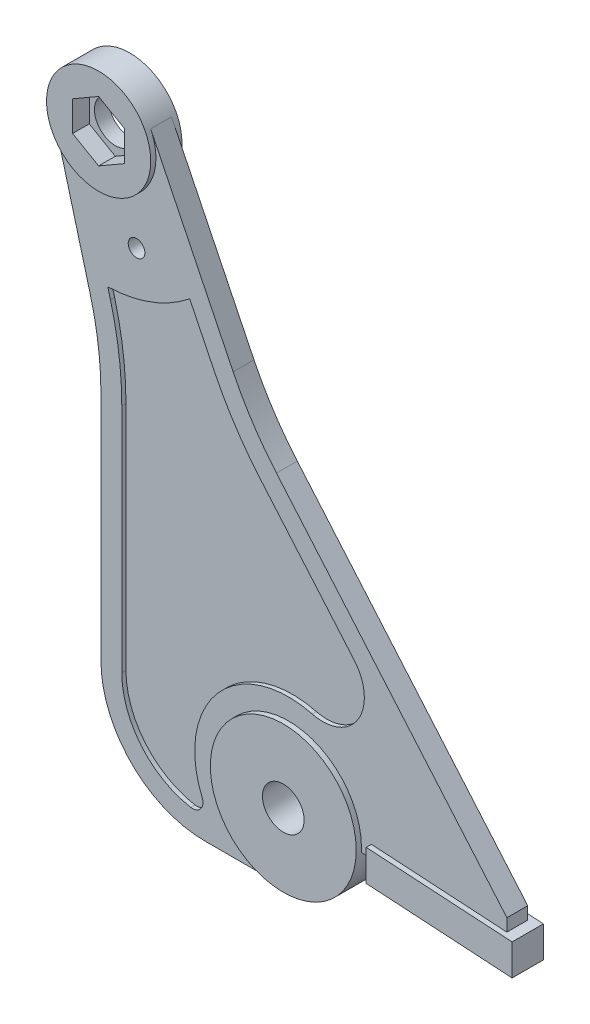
ISO-10303-21;
HEADER;
FILE_DESCRIPTION(('STEP AP214'),'2;1');
FILE_NAME('part.step','',(''),(''),'','','');
FILE_SCHEMA(('AUTOMOTIVE_DESIGN { 1 0 10303 214 1 1 1 1 }'));
ENDSEC;
DATA;
#1=APPLICATION_CONTEXT('core data for automotive mechanical design processes');
#2=APPLICATION_PROTOCOL_DEFINITION('international standard','automotive_design',2000,#1);
#3=PRODUCT_CONTEXT('',#1,'mechanical');
#4=PRODUCT('Part','Part','',(#3));
#5=PRODUCT_RELATED_PRODUCT_CATEGORY('part','',(#4));
#6=PRODUCT_DEFINITION_FORMATION('','',#4);
#7=PRODUCT_DEFINITION_CONTEXT('part definition',#1,'design');
#8=PRODUCT_DEFINITION('design','',#6,#7);
#9=PRODUCT_DEFINITION_SHAPE('','',#8);
#10=(LENGTH_UNIT() NAMED_UNIT(*) SI_UNIT(.MILLI.,.METRE.));
#11=(NAMED_UNIT(*) PLANE_ANGLE_UNIT() SI_UNIT($,.RADIAN.));
#12=(NAMED_UNIT(*) SI_UNIT($,.STERADIAN.) SOLID_ANGLE_UNIT());
#13=UNCERTAINTY_MEASURE_WITH_UNIT(LENGTH_MEASURE(1.E-05),#10,'distance_accuracy_value','');
#14=(GEOMETRIC_REPRESENTATION_CONTEXT(3) GLOBAL_UNCERTAINTY_ASSIGNED_CONTEXT((#13)) GLOBAL_UNIT_ASSIGNED_CONTEXT((#10,
#11,#12)) REPRESENTATION_CONTEXT('',''));
#15=CARTESIAN_POINT('',(0.,0.,0.));
#16=DIRECTION('',(0.,0.,1.));
#17=DIRECTION('',(1.,0.,0.));
#18=AXIS2_PLACEMENT_3D('',#15,#16,#17);
#19=CARTESIAN_POINT('',(-88.6106690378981,237.,7.5));
#20=DIRECTION('',(0.,0.,-1.));
#21=DIRECTION('',(-1.,0.,0.));
#22=AXIS2_PLACEMENT_3D('',#19,#20,#21);
#23=CYLINDRICAL_SURFACE('',#22,10.);
#24=CARTESIAN_POINT('',(-88.6106690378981,237.,-7.5));
#25=DIRECTION('',(0.,0.,1.));
#26=DIRECTION('',(1.,0.,0.));
#27=AXIS2_PLACEMENT_3D('',#24,#25,#26);
#28=CIRCLE('',#27,10.);
#29=CARTESIAN_POINT('',(-78.6106690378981,237.,-7.5));
#30=VERTEX_POINT('',#29);
#31=EDGE_CURVE('E601',#30,#30,#28,.T.);
#32=ORIENTED_EDGE('',*,*,#31,.F.);
#33=EDGE_LOOP('',(#32));
#34=FACE_BOUND('',#33,.T.);
#35=CARTESIAN_POINT('',(-88.6106690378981,237.,-0.5));
#36=DIRECTION('',(0.,0.,1.));
#37=DIRECTION('',(1.,0.,0.));
#38=AXIS2_PLACEMENT_3D('',#35,#36,#37);
#39=CIRCLE('',#38,10.);
#40=CARTESIAN_POINT('',(-78.6106690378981,237.,-0.5));
#41=VERTEX_POINT('',#40);
#42=EDGE_CURVE('E49',#41,#41,#39,.T.);
#43=ORIENTED_EDGE('',*,*,#42,.T.);
#44=EDGE_LOOP('',(#43));
#45=FACE_BOUND('',#44,.T.);
#46=ADVANCED_FACE('F45',(#34,#45),#23,.F.);
#47=CARTESIAN_POINT('',(-240.,125.889124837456,-5.));
#48=DIRECTION('',(0.,0.,1.));
#49=DIRECTION('',(1.,0.,0.));
#50=AXIS2_PLACEMENT_3D('',#47,#48,#49);
#51=PLANE('',#50);
#52=DIRECTION('',(0.998134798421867,-0.0610485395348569,0.));
#53=VECTOR('',#52,1.);
#54=CARTESIAN_POINT('',(-246.410259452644,21.0823092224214,-5.));
#55=LINE('',#54,#53);
#56=CARTESIAN_POINT('',(39.804153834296,3.57668578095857,-5.));
#57=VERTEX_POINT('',#56);
#58=CARTESIAN_POINT('',(104.804153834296,-0.39888452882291,-5.));
#59=VERTEX_POINT('',#58);
#60=EDGE_CURVE('E590',#57,#59,#55,.T.);
#61=ORIENTED_EDGE('',*,*,#60,.F.);
#62=DIRECTION('',(0.,1.,0.));
#63=VECTOR('',#62,1.);
#64=CARTESIAN_POINT('',(39.804153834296,125.889124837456,-5.));
#65=LINE('',#64,#63);
#66=CARTESIAN_POINT('',(39.804153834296,-2.4345263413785,-5.));
#67=VERTEX_POINT('',#66);
#68=EDGE_CURVE('E596',#67,#57,#65,.T.);
#69=ORIENTED_EDGE('',*,*,#68,.F.);
#70=DIRECTION('',(0.998134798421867,-0.061048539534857,0.));
#71=VECTOR('',#70,1.);
#72=CARTESIAN_POINT('',(34.9347179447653,-2.13669888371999,-5.));
#73=LINE('',#72,#71);
#74=CARTESIAN_POINT('',(34.9347179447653,-2.13669888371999,-5.));
#75=VERTEX_POINT('',#74);
#76=EDGE_CURVE('E672',#75,#67,#73,.T.);
#77=ORIENTED_EDGE('',*,*,#76,.F.);
#78=CARTESIAN_POINT('',(0.,0.,-5.));
#79=DIRECTION('',(0.,0.,-1.));
#80=DIRECTION('',(1.,0.,0.));
#81=AXIS2_PLACEMENT_3D('',#78,#79,#80);
#82=CIRCLE('',#81,35.);
#83=CARTESIAN_POINT('',(0.,-35.,-5.));
#84=VERTEX_POINT('',#83);
#85=EDGE_CURVE('E670',#84,#75,#82,.T.);
#86=ORIENTED_EDGE('',*,*,#85,.F.);
#87=DIRECTION('',(1.,0.,0.));
#88=VECTOR('',#87,1.);
#89=CARTESIAN_POINT('',(0.,-35.,-5.));
#90=LINE('',#89,#88);
#91=CARTESIAN_POINT('',(-40.,-35.,-5.));
#92=VERTEX_POINT('',#91);
#93=EDGE_CURVE('E667',#92,#84,#90,.T.);
#94=ORIENTED_EDGE('',*,*,#93,.F.);
#95=CARTESIAN_POINT('',(-40.,15.,-5.));
#96=DIRECTION('',(0.,0.,1.));
#97=DIRECTION('',(1.,0.,0.));
#98=AXIS2_PLACEMENT_3D('',#95,#96,#97);
#99=CIRCLE('',#98,50.);
#100=CARTESIAN_POINT('',(-90.,15.,-5.));
#101=VERTEX_POINT('',#100);
#102=EDGE_CURVE('E665',#101,#92,#99,.T.);
#103=ORIENTED_EDGE('',*,*,#102,.F.);
#104=DIRECTION('',(0.,-1.,0.));
#105=VECTOR('',#104,1.);
#106=CARTESIAN_POINT('',(-90.,125.889124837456,-5.));
#107=LINE('',#106,#105);
#108=CARTESIAN_POINT('',(-90.,125.889124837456,-5.));
#109=VERTEX_POINT('',#108);
#110=EDGE_CURVE('E663',#109,#101,#107,.T.);
#111=ORIENTED_EDGE('',*,*,#110,.F.);
#112=CARTESIAN_POINT('',(-240.,125.889124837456,-5.));
#113=DIRECTION('',(0.,0.,-1.));
#114=DIRECTION('',(1.,0.,0.));
#115=AXIS2_PLACEMENT_3D('',#112,#113,#114);
#116=CIRCLE('',#115,150.);
#117=CARTESIAN_POINT('',(-95.1176955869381,164.736491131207,-5.));
#118=VERTEX_POINT('',#117);
#119=EDGE_CURVE('E626',#118,#109,#116,.T.);
#120=ORIENTED_EDGE('',*,*,#119,.F.);
#121=DIRECTION('',(0.258982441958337,-0.965882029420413,0.));
#122=VECTOR('',#121,1.);
#123=CARTESIAN_POINT('',(-112.757719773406,230.525438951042,-5.));
#124=LINE('',#123,#122);
#125=CARTESIAN_POINT('',(-112.757719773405,230.525438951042,-5.));
#126=VERTEX_POINT('',#125);
#127=EDGE_CURVE('E633',#126,#118,#124,.T.);
#128=ORIENTED_EDGE('',*,*,#127,.F.);
#129=CARTESIAN_POINT('',(-88.6106690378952,237.,-5.));
#130=DIRECTION('',(0.,0.,-1.));
#131=DIRECTION('',(1.,0.,0.));
#132=AXIS2_PLACEMENT_3D('',#129,#130,#131);
#133=CIRCLE('',#132,24.9999999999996);
#134=CARTESIAN_POINT('',(-66.138964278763,247.955477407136,-5.));
#135=VERTEX_POINT('',#134);
#136=EDGE_CURVE('E684',#135,#126,#133,.T.);
#137=ORIENTED_EDGE('',*,*,#136,.F.);
#138=DIRECTION('',(-0.438219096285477,0.898868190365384,0.));
#139=VECTOR('',#138,1.);
#140=CARTESIAN_POINT('',(-26.5513913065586,166.754063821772,-5.));
#141=LINE('',#140,#139);
#142=CARTESIAN_POINT('',(-26.5513913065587,166.754063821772,-5.));
#143=VERTEX_POINT('',#142);
#144=EDGE_CURVE('E681',#143,#135,#141,.T.);
#145=ORIENTED_EDGE('',*,*,#144,.F.);
#146=CARTESIAN_POINT('',(108.278837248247,232.486928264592,-5.));
#147=DIRECTION('',(0.,0.,-1.));
#148=DIRECTION('',(1.,0.,0.));
#149=AXIS2_PLACEMENT_3D('',#146,#147,#148);
#150=CIRCLE('',#149,149.999999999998);
#151=CARTESIAN_POINT('',(-5.78205759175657,135.069721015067,-5.));
#152=VERTEX_POINT('',#151);
#153=EDGE_CURVE('E679',#152,#143,#150,.T.);
#154=ORIENTED_EDGE('',*,*,#153,.F.);
#155=DIRECTION('',(-0.649448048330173,0.76040596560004,0.));
#156=VECTOR('',#155,1.);
#157=CARTESIAN_POINT('',(104.804153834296,5.58990334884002,-5.));
#158=LINE('',#157,#156);
#159=CARTESIAN_POINT('',(104.804153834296,5.58990334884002,-5.));
#160=VERTEX_POINT('',#159);
#161=EDGE_CURVE('E677',#160,#152,#158,.T.);
#162=ORIENTED_EDGE('',*,*,#161,.F.);
#163=DIRECTION('',(0.,1.,0.));
#164=VECTOR('',#163,1.);
#165=CARTESIAN_POINT('',(104.804153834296,-6.41009665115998,-5.));
#166=LINE('',#165,#164);
#167=EDGE_CURVE('E675',#59,#160,#166,.T.);
#168=ORIENTED_EDGE('',*,*,#167,.F.);
#169=EDGE_LOOP('',(#61,#69,#77,#86,#94,#103,#111,#120,#128,#137,#145,#154,#162,#168));
#170=FACE_BOUND('',#169,.T.);
#171=CARTESIAN_POINT('',(-72.907512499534,195.,-5.));
#172=DIRECTION('',(0.,0.,1.));
#173=DIRECTION('',(1.,0.,0.));
#174=AXIS2_PLACEMENT_3D('',#171,#172,#173);
#175=CIRCLE('',#174,3.999999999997);
#176=CARTESIAN_POINT('',(-68.907512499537,195.,-5.));
#177=VERTEX_POINT('',#176);
#178=EDGE_CURVE('E620',#177,#177,#175,.T.);
#179=ORIENTED_EDGE('',*,*,#178,.T.);
#180=EDGE_LOOP('',(#179));
#181=FACE_BOUND('',#180,.T.);
#182=CARTESIAN_POINT('',(-40.,15.,-5.));
#183=DIRECTION('',(0.,0.,1.));
#184=DIRECTION('',(1.,0.,0.));
#185=AXIS2_PLACEMENT_3D('',#182,#183,#184);
#186=CIRCLE('',#185,40.);
#187=CARTESIAN_POINT('',(-80.,15.,-5.));
#188=VERTEX_POINT('',#187);
#189=CARTESIAN_POINT('',(-46.9168893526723,-24.3974192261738,-5.));
#190=VERTEX_POINT('',#189);
#191=EDGE_CURVE('E69',#188,#190,#186,.T.);
#192=ORIENTED_EDGE('',*,*,#191,.T.);
#193=CARTESIAN_POINT('',(-46.0522781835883,-19.4727418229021,-5.));
#194=DIRECTION('',(0.,0.,1.));
#195=DIRECTION('',(1.,0.,0.));
#196=AXIS2_PLACEMENT_3D('',#193,#194,#195);
#197=CIRCLE('',#196,5.);
#198=CARTESIAN_POINT('',(-41.4470503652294,-17.5254676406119,-5.));
#199=VERTEX_POINT('',#198);
#200=EDGE_CURVE('E399',#190,#199,#197,.T.);
#201=ORIENTED_EDGE('',*,*,#200,.T.);
#202=CARTESIAN_POINT('',(0.,0.,-5.));
#203=DIRECTION('',(0.,0.,-1.));
#204=DIRECTION('',(1.,0.,0.));
#205=AXIS2_PLACEMENT_3D('',#202,#203,#204);
#206=CIRCLE('',#205,45.);
#207=CARTESIAN_POINT('',(11.3597331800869,43.5425821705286,-5.));
#208=VERTEX_POINT('',#207);
#209=EDGE_CURVE('E445',#199,#208,#206,.T.);
#210=ORIENTED_EDGE('',*,*,#209,.T.);
#211=CARTESIAN_POINT('',(16.4085034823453,62.8948409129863,-5.));
#212=DIRECTION('',(0.,0.,1.));
#213=DIRECTION('',(1.,0.,0.));
#214=AXIS2_PLACEMENT_3D('',#211,#212,#213);
#215=CIRCLE('',#214,20.0000000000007);
#216=CARTESIAN_POINT('',(31.616622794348,75.8838018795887,-5.));
#217=VERTEX_POINT('',#216);
#218=EDGE_CURVE('E442',#208,#217,#215,.T.);
#219=ORIENTED_EDGE('',*,*,#218,.T.);
#220=DIRECTION('',(-0.649448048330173,0.76040596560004,0.));
#221=VECTOR('',#220,1.);
#222=CARTESIAN_POINT('',(31.6166227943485,75.8838018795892,-5.));
#223=LINE('',#222,#221);
#224=CARTESIAN_POINT('',(-13.386117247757,128.575240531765,-5.));
#225=VERTEX_POINT('',#224);
#226=EDGE_CURVE('E439',#217,#225,#223,.T.);
#227=ORIENTED_EDGE('',*,*,#226,.T.);
#228=CARTESIAN_POINT('',(108.278837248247,232.486928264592,-5.));
#229=DIRECTION('',(0.,0.,-1.));
#230=DIRECTION('',(1.,0.,0.));
#231=AXIS2_PLACEMENT_3D('',#228,#229,#230);
#232=CIRCLE('',#231,159.999999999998);
#233=CARTESIAN_POINT('',(-35.5400732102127,162.371872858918,-5.));
#234=VERTEX_POINT('',#233);
#235=EDGE_CURVE('E436',#225,#234,#232,.T.);
#236=ORIENTED_EDGE('',*,*,#235,.T.);
#237=DIRECTION('',(-0.438219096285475,0.898868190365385,0.));
#238=VECTOR('',#237,1.);
#239=CARTESIAN_POINT('',(-35.5400732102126,162.371872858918,-5.));
#240=LINE('',#239,#238);
#241=CARTESIAN_POINT('',(-47.4122370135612,186.723870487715,-5.));
#242=VERTEX_POINT('',#241);
#243=EDGE_CURVE('E433',#234,#242,#240,.T.);
#244=ORIENTED_EDGE('',*,*,#243,.T.);
#245=CARTESIAN_POINT('',(-88.6106690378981,237.,-5.));
#246=DIRECTION('',(0.,0.,-1.));
#247=DIRECTION('',(1.,0.,0.));
#248=AXIS2_PLACEMENT_3D('',#245,#246,#247);
#249=CIRCLE('',#248,65.);
#250=CARTESIAN_POINT('',(-86.7194116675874,172.02752009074,-5.));
#251=VERTEX_POINT('',#250);
#252=EDGE_CURVE('E430',#242,#251,#249,.T.);
#253=ORIENTED_EDGE('',*,*,#252,.T.);
#254=DIRECTION('',(0.258982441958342,-0.965882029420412,0.));
#255=VECTOR('',#254,1.);
#256=CARTESIAN_POINT('',(-85.4588752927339,167.32631555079,-5.));
#257=LINE('',#256,#255);
#258=CARTESIAN_POINT('',(-85.4588752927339,167.32631555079,-5.));
#259=VERTEX_POINT('',#258);
#260=EDGE_CURVE('E427',#251,#259,#257,.T.);
#261=ORIENTED_EDGE('',*,*,#260,.T.);
#262=CARTESIAN_POINT('',(-240.,125.889124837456,-5.));
#263=DIRECTION('',(0.,0.,-1.));
#264=DIRECTION('',(1.,0.,0.));
#265=AXIS2_PLACEMENT_3D('',#262,#263,#264);
#266=CIRCLE('',#265,160.);
#267=CARTESIAN_POINT('',(-80.,125.889124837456,-5.));
#268=VERTEX_POINT('',#267);
#269=EDGE_CURVE('E424',#259,#268,#266,.T.);
#270=ORIENTED_EDGE('',*,*,#269,.T.);
#271=DIRECTION('',(0.,-1.,0.));
#272=VECTOR('',#271,1.);
#273=CARTESIAN_POINT('',(-80.,125.889124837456,-5.));
#274=LINE('',#273,#272);
#275=EDGE_CURVE('E421',#268,#188,#274,.T.);
#276=ORIENTED_EDGE('',*,*,#275,.T.);
#277=EDGE_LOOP('',(#192,#201,#210,#219,#227,#236,#244,#253,#261,#270,#276));
#278=FACE_BOUND('',#277,.T.);
#279=ADVANCED_FACE('F729',(#170,#181,#278),#51,.F.);
#280=CARTESIAN_POINT('',(-240.,125.889124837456,5.));
#281=DIRECTION('',(0.,0.,1.));
#282=DIRECTION('',(1.,0.,0.));
#283=AXIS2_PLACEMENT_3D('',#280,#281,#282);
#284=PLANE('',#283);
#285=CARTESIAN_POINT('',(-40.,15.,5.));
#286=DIRECTION('',(0.,0.,1.));
#287=DIRECTION('',(1.,0.,0.));
#288=AXIS2_PLACEMENT_3D('',#285,#286,#287);
#289=CIRCLE('',#288,40.);
#290=CARTESIAN_POINT('',(-80.,15.,5.));
#291=VERTEX_POINT('',#290);
#292=CARTESIAN_POINT('',(-46.9168893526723,-24.3974192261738,5.));
#293=VERTEX_POINT('',#292);
#294=EDGE_CURVE('E452',#291,#293,#289,.T.);
#295=ORIENTED_EDGE('',*,*,#294,.F.);
#296=DIRECTION('',(0.,-1.,0.));
#297=VECTOR('',#296,1.);
#298=CARTESIAN_POINT('',(-80.,125.889124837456,5.));
#299=LINE('',#298,#297);
#300=CARTESIAN_POINT('',(-80.,125.889124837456,5.));
#301=VERTEX_POINT('',#300);
#302=EDGE_CURVE('E476',#301,#291,#299,.T.);
#303=ORIENTED_EDGE('',*,*,#302,.F.);
#304=CARTESIAN_POINT('',(-240.,125.889124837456,5.));
#305=DIRECTION('',(0.,0.,-1.));
#306=DIRECTION('',(1.,0.,0.));
#307=AXIS2_PLACEMENT_3D('',#304,#305,#306);
#308=CIRCLE('',#307,160.);
#309=CARTESIAN_POINT('',(-85.4588752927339,167.32631555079,5.));
#310=VERTEX_POINT('',#309);
#311=EDGE_CURVE('E532',#310,#301,#308,.T.);
#312=ORIENTED_EDGE('',*,*,#311,.F.);
#313=DIRECTION('',(0.258982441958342,-0.965882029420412,0.));
#314=VECTOR('',#313,1.);
#315=CARTESIAN_POINT('',(-85.4588752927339,167.32631555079,5.));
#316=LINE('',#315,#314);
#317=CARTESIAN_POINT('',(-86.7194116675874,172.02752009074,5.));
#318=VERTEX_POINT('',#317);
#319=EDGE_CURVE('E529',#318,#310,#316,.T.);
#320=ORIENTED_EDGE('',*,*,#319,.F.);
#321=CARTESIAN_POINT('',(-88.6106690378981,237.,5.));
#322=DIRECTION('',(0.,0.,-1.));
#323=DIRECTION('',(1.,0.,0.));
#324=AXIS2_PLACEMENT_3D('',#321,#322,#323);
#325=CIRCLE('',#324,65.);
#326=CARTESIAN_POINT('',(-47.4122370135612,186.723870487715,5.));
#327=VERTEX_POINT('',#326);
#328=EDGE_CURVE('E526',#327,#318,#325,.T.);
#329=ORIENTED_EDGE('',*,*,#328,.F.);
#330=DIRECTION('',(-0.438219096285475,0.898868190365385,0.));
#331=VECTOR('',#330,1.);
#332=CARTESIAN_POINT('',(-35.5400732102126,162.371872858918,5.));
#333=LINE('',#332,#331);
#334=CARTESIAN_POINT('',(-35.5400732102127,162.371872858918,5.));
#335=VERTEX_POINT('',#334);
#336=EDGE_CURVE('E523',#335,#327,#333,.T.);
#337=ORIENTED_EDGE('',*,*,#336,.F.);
#338=CARTESIAN_POINT('',(108.278837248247,232.486928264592,5.));
#339=DIRECTION('',(0.,0.,-1.));
#340=DIRECTION('',(1.,0.,0.));
#341=AXIS2_PLACEMENT_3D('',#338,#339,#340);
#342=CIRCLE('',#341,159.999999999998);
#343=CARTESIAN_POINT('',(-13.386117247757,128.575240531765,5.));
#344=VERTEX_POINT('',#343);
#345=EDGE_CURVE('E520',#344,#335,#342,.T.);
#346=ORIENTED_EDGE('',*,*,#345,.F.);
#347=DIRECTION('',(-0.649448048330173,0.76040596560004,0.));
#348=VECTOR('',#347,1.);
#349=CARTESIAN_POINT('',(31.6166227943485,75.8838018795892,5.));
#350=LINE('',#349,#348);
#351=CARTESIAN_POINT('',(31.616622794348,75.8838018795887,5.));
#352=VERTEX_POINT('',#351);
#353=EDGE_CURVE('E517',#352,#344,#350,.T.);
#354=ORIENTED_EDGE('',*,*,#353,.F.);
#355=CARTESIAN_POINT('',(16.4085034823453,62.8948409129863,5.));
#356=DIRECTION('',(0.,0.,1.));
#357=DIRECTION('',(1.,0.,0.));
#358=AXIS2_PLACEMENT_3D('',#355,#356,#357);
#359=CIRCLE('',#358,20.0000000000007);
#360=CARTESIAN_POINT('',(11.3597331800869,43.5425821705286,5.));
#361=VERTEX_POINT('',#360);
#362=EDGE_CURVE('E514',#361,#352,#359,.T.);
#363=ORIENTED_EDGE('',*,*,#362,.F.);
#364=CARTESIAN_POINT('',(0.,0.,5.));
#365=DIRECTION('',(0.,0.,-1.));
#366=DIRECTION('',(1.,0.,0.));
#367=AXIS2_PLACEMENT_3D('',#364,#365,#366);
#368=CIRCLE('',#367,45.);
#369=CARTESIAN_POINT('',(-41.4470503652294,-17.5254676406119,5.));
#370=VERTEX_POINT('',#369);
#371=EDGE_CURVE('E511',#370,#361,#368,.T.);
#372=ORIENTED_EDGE('',*,*,#371,.F.);
#373=CARTESIAN_POINT('',(-46.0522781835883,-19.4727418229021,5.));
#374=DIRECTION('',(0.,0.,1.));
#375=DIRECTION('',(1.,0.,0.));
#376=AXIS2_PLACEMENT_3D('',#373,#374,#375);
#377=CIRCLE('',#376,5.);
#378=EDGE_CURVE('E508',#293,#370,#377,.T.);
#379=ORIENTED_EDGE('',*,*,#378,.F.);
#380=EDGE_LOOP('',(#295,#303,#312,#320,#329,#337,#346,#354,#363,#372,#379));
#381=FACE_BOUND('',#380,.T.);
#382=CARTESIAN_POINT('',(-72.907512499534,195.,5.));
#383=DIRECTION('',(0.,0.,1.));
#384=DIRECTION('',(1.,0.,0.));
#385=AXIS2_PLACEMENT_3D('',#382,#383,#384);
#386=CIRCLE('',#385,3.999999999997);
#387=CARTESIAN_POINT('',(-68.907512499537,195.,5.));
#388=VERTEX_POINT('',#387);
#389=EDGE_CURVE('E623',#388,#388,#386,.T.);
#390=ORIENTED_EDGE('',*,*,#389,.F.);
#391=EDGE_LOOP('',(#390));
#392=FACE_BOUND('',#391,.T.);
#393=DIRECTION('',(0.,1.,0.));
#394=VECTOR('',#393,1.);
#395=CARTESIAN_POINT('',(39.804153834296,125.889124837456,5.));
#396=LINE('',#395,#394);
#397=CARTESIAN_POINT('',(39.804153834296,-2.4345263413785,5.));
#398=VERTEX_POINT('',#397);
#399=CARTESIAN_POINT('',(39.804153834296,3.57668578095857,5.));
#400=VERTEX_POINT('',#399);
#401=EDGE_CURVE('E599',#398,#400,#396,.T.);
#402=ORIENTED_EDGE('',*,*,#401,.T.);
#403=DIRECTION('',(0.998134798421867,-0.0610485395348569,0.));
#404=VECTOR('',#403,1.);
#405=CARTESIAN_POINT('',(-246.410259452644,21.0823092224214,5.));
#406=LINE('',#405,#404);
#407=CARTESIAN_POINT('',(104.804153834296,-0.39888452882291,5.));
#408=VERTEX_POINT('',#407);
#409=EDGE_CURVE('E593',#400,#408,#406,.T.);
#410=ORIENTED_EDGE('',*,*,#409,.T.);
#411=DIRECTION('',(0.,1.,0.));
#412=VECTOR('',#411,1.);
#413=CARTESIAN_POINT('',(104.804153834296,-6.41009665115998,5.));
#414=LINE('',#413,#412);
#415=CARTESIAN_POINT('',(104.804153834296,5.58990334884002,5.));
#416=VERTEX_POINT('',#415);
#417=EDGE_CURVE('E646',#408,#416,#414,.T.);
#418=ORIENTED_EDGE('',*,*,#417,.T.);
#419=DIRECTION('',(-0.649448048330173,0.76040596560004,0.));
#420=VECTOR('',#419,1.);
#421=CARTESIAN_POINT('',(104.804153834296,5.58990334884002,5.));
#422=LINE('',#421,#420);
#423=CARTESIAN_POINT('',(-5.78205759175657,135.069721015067,5.));
#424=VERTEX_POINT('',#423);
#425=EDGE_CURVE('E648',#416,#424,#422,.T.);
#426=ORIENTED_EDGE('',*,*,#425,.T.);
#427=CARTESIAN_POINT('',(108.278837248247,232.486928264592,5.));
#428=DIRECTION('',(0.,0.,-1.));
#429=DIRECTION('',(1.,0.,0.));
#430=AXIS2_PLACEMENT_3D('',#427,#428,#429);
#431=CIRCLE('',#430,149.999999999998);
#432=CARTESIAN_POINT('',(-26.5513913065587,166.754063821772,5.));
#433=VERTEX_POINT('',#432);
#434=EDGE_CURVE('E650',#424,#433,#431,.T.);
#435=ORIENTED_EDGE('',*,*,#434,.T.);
#436=DIRECTION('',(-0.438219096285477,0.898868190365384,0.));
#437=VECTOR('',#436,1.);
#438=CARTESIAN_POINT('',(-26.5513913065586,166.754063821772,5.));
#439=LINE('',#438,#437);
#440=CARTESIAN_POINT('',(-66.1389642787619,247.955477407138,5.));
#441=VERTEX_POINT('',#440);
#442=EDGE_CURVE('E652',#433,#441,#439,.T.);
#443=ORIENTED_EDGE('',*,*,#442,.T.);
#444=CARTESIAN_POINT('',(-88.6106690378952,237.,5.));
#445=DIRECTION('',(0.,0.,-1.));
#446=DIRECTION('',(1.,0.,0.));
#447=AXIS2_PLACEMENT_3D('',#444,#445,#446);
#448=CIRCLE('',#447,24.9999999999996);
#449=CARTESIAN_POINT('',(-112.757719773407,230.525438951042,5.));
#450=VERTEX_POINT('',#449);
#451=EDGE_CURVE('E655',#441,#450,#448,.T.);
#452=ORIENTED_EDGE('',*,*,#451,.T.);
#453=DIRECTION('',(0.258982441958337,-0.965882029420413,0.));
#454=VECTOR('',#453,1.);
#455=CARTESIAN_POINT('',(-112.757719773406,230.525438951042,5.));
#456=LINE('',#455,#454);
#457=CARTESIAN_POINT('',(-95.1176955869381,164.736491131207,5.));
#458=VERTEX_POINT('',#457);
#459=EDGE_CURVE('E658',#450,#458,#456,.T.);
#460=ORIENTED_EDGE('',*,*,#459,.T.);
#461=CARTESIAN_POINT('',(-240.,125.889124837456,5.));
#462=DIRECTION('',(0.,0.,-1.));
#463=DIRECTION('',(1.,0.,0.));
#464=AXIS2_PLACEMENT_3D('',#461,#462,#463);
#465=CIRCLE('',#464,150.);
#466=CARTESIAN_POINT('',(-90.,125.889124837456,5.));
#467=VERTEX_POINT('',#466);
#468=EDGE_CURVE('E629',#458,#467,#465,.T.);
#469=ORIENTED_EDGE('',*,*,#468,.T.);
#470=DIRECTION('',(0.,-1.,0.));
#471=VECTOR('',#470,1.);
#472=CARTESIAN_POINT('',(-90.,125.889124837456,5.));
#473=LINE('',#472,#471);
#474=CARTESIAN_POINT('',(-90.,15.,5.));
#475=VERTEX_POINT('',#474);
#476=EDGE_CURVE('E632',#467,#475,#473,.T.);
#477=ORIENTED_EDGE('',*,*,#476,.T.);
#478=CARTESIAN_POINT('',(-40.,15.,5.));
#479=DIRECTION('',(0.,0.,1.));
#480=DIRECTION('',(1.,0.,0.));
#481=AXIS2_PLACEMENT_3D('',#478,#479,#480);
#482=CIRCLE('',#481,50.);
#483=CARTESIAN_POINT('',(-40.,-35.,5.));
#484=VERTEX_POINT('',#483);
#485=EDGE_CURVE('E635',#475,#484,#482,.T.);
#486=ORIENTED_EDGE('',*,*,#485,.T.);
#487=DIRECTION('',(1.,0.,0.));
#488=VECTOR('',#487,1.);
#489=CARTESIAN_POINT('',(0.,-35.,5.));
#490=LINE('',#489,#488);
#491=CARTESIAN_POINT('',(0.,-35.,5.));
#492=VERTEX_POINT('',#491);
#493=EDGE_CURVE('E637',#484,#492,#490,.T.);
#494=ORIENTED_EDGE('',*,*,#493,.T.);
#495=CARTESIAN_POINT('',(0.,0.,5.));
#496=DIRECTION('',(0.,0.,-1.));
#497=DIRECTION('',(1.,0.,0.));
#498=AXIS2_PLACEMENT_3D('',#495,#496,#497);
#499=CIRCLE('',#498,35.);
#500=CARTESIAN_POINT('',(34.9347179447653,-2.13669888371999,5.));
#501=VERTEX_POINT('',#500);
#502=EDGE_CURVE('E640',#492,#501,#499,.T.);
#503=ORIENTED_EDGE('',*,*,#502,.T.);
#504=DIRECTION('',(0.998134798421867,-0.061048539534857,0.));
#505=VECTOR('',#504,1.);
#506=CARTESIAN_POINT('',(34.9347179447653,-2.13669888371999,5.));
#507=LINE('',#506,#505);
#508=EDGE_CURVE('E643',#501,#398,#507,.T.);
#509=ORIENTED_EDGE('',*,*,#508,.T.);
#510=EDGE_LOOP('',(#402,#410,#418,#426,#435,#443,#452,#460,#469,#477,#486,#494,#503,#509));
#511=FACE_BOUND('',#510,.T.);
#512=ADVANCED_FACE('F743',(#381,#392,#511),#284,.T.);
#513=CARTESIAN_POINT('',(34.9347179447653,-2.13669888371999,5.));
#514=DIRECTION('',(0.061048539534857,0.998134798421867,0.));
#515=DIRECTION('',(-0.998134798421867,0.061048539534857,0.));
#516=AXIS2_PLACEMENT_3D('',#513,#514,#515);
#517=PLANE('',#516);
#518=DIRECTION('',(0.,0.,-1.));
#519=VECTOR('',#518,1.);
#520=CARTESIAN_POINT('',(39.804153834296,-2.4345263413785,5.));
#521=LINE('',#520,#519);
#522=EDGE_CURVE('E13',#398,#67,#521,.T.);
#523=ORIENTED_EDGE('',*,*,#522,.F.);
#524=ORIENTED_EDGE('',*,*,#508,.F.);
#525=DIRECTION('',(0.,0.,-1.));
#526=VECTOR('',#525,1.);
#527=CARTESIAN_POINT('',(34.9347179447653,-2.13669888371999,5.));
#528=LINE('',#527,#526);
#529=EDGE_CURVE('E703',#501,#75,#528,.T.);
#530=ORIENTED_EDGE('',*,*,#529,.T.);
#531=ORIENTED_EDGE('',*,*,#76,.T.);
#532=EDGE_LOOP('',(#523,#524,#530,#531));
#533=FACE_BOUND('',#532,.T.);
#534=ADVANCED_FACE('F768',(#533),#517,.F.);
#535=CARTESIAN_POINT('',(104.804153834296,-6.41009665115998,5.));
#536=DIRECTION('',(-1.,0.,0.));
#537=DIRECTION('',(0.,-1.,0.));
#538=AXIS2_PLACEMENT_3D('',#535,#536,#537);
#539=PLANE('',#538);
#540=DIRECTION('',(0.,0.,1.));
#541=VECTOR('',#540,1.);
#542=CARTESIAN_POINT('',(104.804153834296,-0.39888452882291,5.));
#543=LINE('',#542,#541);
#544=EDGE_CURVE('E54',#59,#408,#543,.T.);
#545=ORIENTED_EDGE('',*,*,#544,.F.);
#546=ORIENTED_EDGE('',*,*,#167,.T.);
#547=DIRECTION('',(0.,0.,-1.));
#548=VECTOR('',#547,1.);
#549=CARTESIAN_POINT('',(104.804153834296,5.58990334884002,5.));
#550=LINE('',#549,#548);
#551=EDGE_CURVE('E700',#416,#160,#550,.T.);
#552=ORIENTED_EDGE('',*,*,#551,.F.);
#553=ORIENTED_EDGE('',*,*,#417,.F.);
#554=EDGE_LOOP('',(#545,#546,#552,#553));
#555=FACE_BOUND('',#554,.T.);
#556=ADVANCED_FACE('F725',(#555),#539,.F.);
#557=CARTESIAN_POINT('',(-240.,125.889124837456,5.));
#558=DIRECTION('',(0.,0.,-1.));
#559=DIRECTION('',(-1.,0.,0.));
#560=AXIS2_PLACEMENT_3D('',#557,#558,#559);
#561=CYLINDRICAL_SURFACE('',#560,150.);
#562=ORIENTED_EDGE('',*,*,#119,.T.);
#563=DIRECTION('',(0.,0.,-1.));
#564=VECTOR('',#563,1.);
#565=CARTESIAN_POINT('',(-90.,125.889124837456,5.));
#566=LINE('',#565,#564);
#567=EDGE_CURVE('E714',#467,#109,#566,.T.);
#568=ORIENTED_EDGE('',*,*,#567,.F.);
#569=ORIENTED_EDGE('',*,*,#468,.F.);
#570=DIRECTION('',(0.,0.,-1.));
#571=VECTOR('',#570,1.);
#572=CARTESIAN_POINT('',(-95.1176955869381,164.736491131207,5.));
#573=LINE('',#572,#571);
#574=EDGE_CURVE('E660',#458,#118,#573,.T.);
#575=ORIENTED_EDGE('',*,*,#574,.T.);
#576=EDGE_LOOP('',(#562,#568,#569,#575));
#577=FACE_BOUND('',#576,.T.);
#578=ADVANCED_FACE('F47',(#577),#561,.F.);
#579=CARTESIAN_POINT('',(-90.,125.889124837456,5.));
#580=DIRECTION('',(1.,0.,0.));
#581=DIRECTION('',(0.,0.,-1.));
#582=AXIS2_PLACEMENT_3D('',#579,#580,#581);
#583=PLANE('',#582);
#584=ORIENTED_EDGE('',*,*,#110,.T.);
#585=DIRECTION('',(0.,0.,-1.));
#586=VECTOR('',#585,1.);
#587=CARTESIAN_POINT('',(-90.,15.,5.));
#588=LINE('',#587,#586);
#589=EDGE_CURVE('E711',#475,#101,#588,.T.);
#590=ORIENTED_EDGE('',*,*,#589,.F.);
#591=ORIENTED_EDGE('',*,*,#476,.F.);
#592=ORIENTED_EDGE('',*,*,#567,.T.);
#593=EDGE_LOOP('',(#584,#590,#591,#592));
#594=FACE_BOUND('',#593,.T.);
#595=ADVANCED_FACE('F785',(#594),#583,.F.);
#596=CARTESIAN_POINT('',(-40.,15.,5.));
#597=DIRECTION('',(0.,0.,-1.));
#598=DIRECTION('',(-1.,0.,0.));
#599=AXIS2_PLACEMENT_3D('',#596,#597,#598);
#600=CYLINDRICAL_SURFACE('',#599,50.);
#601=ORIENTED_EDGE('',*,*,#102,.T.);
#602=DIRECTION('',(0.,0.,-1.));
#603=VECTOR('',#602,1.);
#604=CARTESIAN_POINT('',(-40.,-35.,5.));
#605=LINE('',#604,#603);
#606=EDGE_CURVE('E708',#484,#92,#605,.T.);
#607=ORIENTED_EDGE('',*,*,#606,.F.);
#608=ORIENTED_EDGE('',*,*,#485,.F.);
#609=ORIENTED_EDGE('',*,*,#589,.T.);
#610=EDGE_LOOP('',(#601,#607,#608,#609));
#611=FACE_BOUND('',#610,.T.);
#612=ADVANCED_FACE('F782',(#611),#600,.T.);
#613=CARTESIAN_POINT('',(0.,-35.,5.));
#614=DIRECTION('',(0.,1.,0.));
#615=DIRECTION('',(-1.,0.,0.));
#616=AXIS2_PLACEMENT_3D('',#613,#614,#615);
#617=PLANE('',#616);
#618=ORIENTED_EDGE('',*,*,#93,.T.);
#619=DIRECTION('',(0.,0.,-1.));
#620=VECTOR('',#619,1.);
#621=CARTESIAN_POINT('',(0.,-35.,5.));
#622=LINE('',#621,#620);
#623=EDGE_CURVE('E706',#492,#84,#622,.T.);
#624=ORIENTED_EDGE('',*,*,#623,.F.);
#625=ORIENTED_EDGE('',*,*,#493,.F.);
#626=ORIENTED_EDGE('',*,*,#606,.T.);
#627=EDGE_LOOP('',(#618,#624,#625,#626));
#628=FACE_BOUND('',#627,.T.);
#629=ADVANCED_FACE('F777',(#628),#617,.F.);
#630=CARTESIAN_POINT('',(104.804153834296,5.58990334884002,5.));
#631=DIRECTION('',(-0.76040596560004,-0.649448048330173,0.));
#632=DIRECTION('',(0.649448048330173,-0.76040596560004,0.));
#633=AXIS2_PLACEMENT_3D('',#630,#631,#632);
#634=PLANE('',#633);
#635=ORIENTED_EDGE('',*,*,#161,.T.);
#636=DIRECTION('',(0.,0.,-1.));
#637=VECTOR('',#636,1.);
#638=CARTESIAN_POINT('',(-5.78205759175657,135.069721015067,5.));
#639=LINE('',#638,#637);
#640=EDGE_CURVE('E697',#424,#152,#639,.T.);
#641=ORIENTED_EDGE('',*,*,#640,.F.);
#642=ORIENTED_EDGE('',*,*,#425,.F.);
#643=ORIENTED_EDGE('',*,*,#551,.T.);
#644=EDGE_LOOP('',(#635,#641,#642,#643));
#645=FACE_BOUND('',#644,.T.);
#646=ADVANCED_FACE('F735',(#645),#634,.F.);
#647=CARTESIAN_POINT('',(108.278837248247,232.486928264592,5.));
#648=DIRECTION('',(0.,0.,-1.));
#649=DIRECTION('',(-1.,0.,0.));
#650=AXIS2_PLACEMENT_3D('',#647,#648,#649);
#651=CYLINDRICAL_SURFACE('',#650,149.999999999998);
#652=ORIENTED_EDGE('',*,*,#153,.T.);
#653=DIRECTION('',(0.,0.,-1.));
#654=VECTOR('',#653,1.);
#655=CARTESIAN_POINT('',(-26.5513913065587,166.754063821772,5.));
#656=LINE('',#655,#654);
#657=EDGE_CURVE('E694',#433,#143,#656,.T.);
#658=ORIENTED_EDGE('',*,*,#657,.F.);
#659=ORIENTED_EDGE('',*,*,#434,.F.);
#660=ORIENTED_EDGE('',*,*,#640,.T.);
#661=EDGE_LOOP('',(#652,#658,#659,#660));
#662=FACE_BOUND('',#661,.T.);
#663=ADVANCED_FACE('F739',(#662),#651,.F.);
#664=CARTESIAN_POINT('',(-26.5513913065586,166.754063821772,5.));
#665=DIRECTION('',(-0.898868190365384,-0.438219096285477,0.));
#666=DIRECTION('',(0.438219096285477,-0.898868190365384,0.));
#667=AXIS2_PLACEMENT_3D('',#664,#665,#666);
#668=PLANE('',#667);
#669=ORIENTED_EDGE('',*,*,#144,.T.);
#670=DIRECTION('',(0.,0.,-1.));
#671=VECTOR('',#670,1.);
#672=CARTESIAN_POINT('',(-66.1389642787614,247.955477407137,5.));
#673=LINE('',#672,#671);
#674=EDGE_CURVE('E692',#441,#135,#673,.T.);
#675=ORIENTED_EDGE('',*,*,#674,.F.);
#676=ORIENTED_EDGE('',*,*,#442,.F.);
#677=ORIENTED_EDGE('',*,*,#657,.T.);
#678=EDGE_LOOP('',(#669,#675,#676,#677));
#679=FACE_BOUND('',#678,.T.);
#680=ADVANCED_FACE('F799',(#679),#668,.F.);
#681=CARTESIAN_POINT('',(-112.757719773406,230.525438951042,5.));
#682=DIRECTION('',(0.965882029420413,0.258982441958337,0.));
#683=DIRECTION('',(-0.258982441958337,0.965882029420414,0.));
#684=AXIS2_PLACEMENT_3D('',#681,#682,#683);
#685=PLANE('',#684);
#686=ORIENTED_EDGE('',*,*,#127,.T.);
#687=ORIENTED_EDGE('',*,*,#574,.F.);
#688=ORIENTED_EDGE('',*,*,#459,.F.);
#689=DIRECTION('',(0.,0.,-1.));
#690=VECTOR('',#689,1.);
#691=CARTESIAN_POINT('',(-112.757719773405,230.525438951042,5.));
#692=LINE('',#691,#690);
#693=EDGE_CURVE('E689',#450,#126,#692,.T.);
#694=ORIENTED_EDGE('',*,*,#693,.T.);
#695=EDGE_LOOP('',(#686,#687,#688,#694));
#696=FACE_BOUND('',#695,.T.);
#697=ADVANCED_FACE('F793',(#696),#685,.F.);
#698=CARTESIAN_POINT('',(-72.907512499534,195.,5.));
#699=DIRECTION('',(0.,0.,-1.));
#700=DIRECTION('',(-1.,0.,0.));
#701=AXIS2_PLACEMENT_3D('',#698,#699,#700);
#702=CYLINDRICAL_SURFACE('',#701,3.999999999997);
#703=ORIENTED_EDGE('',*,*,#389,.T.);
#704=EDGE_LOOP('',(#703));
#705=FACE_BOUND('',#704,.T.);
#706=ORIENTED_EDGE('',*,*,#178,.F.);
#707=EDGE_LOOP('',(#706));
#708=FACE_BOUND('',#707,.T.);
#709=ADVANCED_FACE('F806',(#705,#708),#702,.F.);
#710=CARTESIAN_POINT('',(0.,0.,7.5));
#711=DIRECTION('',(0.,0.,1.));
#712=DIRECTION('',(1.,0.,0.));
#713=AXIS2_PLACEMENT_3D('',#710,#711,#712);
#714=PLANE('',#713);
#715=CARTESIAN_POINT('',(0.,0.,7.5));
#716=DIRECTION('',(0.,0.,1.));
#717=DIRECTION('',(1.,0.,0.));
#718=AXIS2_PLACEMENT_3D('',#715,#716,#717);
#719=CIRCLE('',#718,35.);
#720=CARTESIAN_POINT('',(35.,0.,7.5));
#721=VERTEX_POINT('',#720);
#722=EDGE_CURVE('E617',#721,#721,#719,.T.);
#723=ORIENTED_EDGE('',*,*,#722,.T.);
#724=EDGE_LOOP('',(#723));
#725=FACE_BOUND('',#724,.T.);
#726=CARTESIAN_POINT('',(0.,0.,7.5));
#727=DIRECTION('',(0.,0.,1.));
#728=DIRECTION('',(1.,0.,0.));
#729=AXIS2_PLACEMENT_3D('',#726,#727,#728);
#730=CIRCLE('',#729,10.);
#731=CARTESIAN_POINT('',(10.,0.,7.5));
#732=VERTEX_POINT('',#731);
#733=EDGE_CURVE('E611',#732,#732,#730,.T.);
#734=ORIENTED_EDGE('',*,*,#733,.F.);
#735=EDGE_LOOP('',(#734));
#736=FACE_BOUND('',#735,.T.);
#737=ADVANCED_FACE('F835',(#725,#736),#714,.T.);
#738=CARTESIAN_POINT('',(0.,0.,-7.5));
#739=DIRECTION('',(0.,0.,1.));
#740=DIRECTION('',(1.,0.,0.));
#741=AXIS2_PLACEMENT_3D('',#738,#739,#740);
#742=PLANE('',#741);
#743=CARTESIAN_POINT('',(0.,0.,-7.5));
#744=DIRECTION('',(0.,0.,1.));
#745=DIRECTION('',(1.,0.,0.));
#746=AXIS2_PLACEMENT_3D('',#743,#744,#745);
#747=CIRCLE('',#746,35.);
#748=CARTESIAN_POINT('',(35.,0.,-7.5));
#749=VERTEX_POINT('',#748);
#750=EDGE_CURVE('E614',#749,#749,#747,.T.);
#751=ORIENTED_EDGE('',*,*,#750,.F.);
#752=EDGE_LOOP('',(#751));
#753=FACE_BOUND('',#752,.T.);
#754=CARTESIAN_POINT('',(0.,0.,-7.5));
#755=DIRECTION('',(0.,0.,1.));
#756=DIRECTION('',(1.,0.,0.));
#757=AXIS2_PLACEMENT_3D('',#754,#755,#756);
#758=CIRCLE('',#757,10.);
#759=CARTESIAN_POINT('',(10.,0.,-7.5));
#760=VERTEX_POINT('',#759);
#761=EDGE_CURVE('E608',#760,#760,#758,.T.);
#762=ORIENTED_EDGE('',*,*,#761,.T.);
#763=EDGE_LOOP('',(#762));
#764=FACE_BOUND('',#763,.T.);
#765=ADVANCED_FACE('F838',(#753,#764),#742,.F.);
#766=CARTESIAN_POINT('',(0.,0.,7.5));
#767=DIRECTION('',(0.,0.,-1.));
#768=DIRECTION('',(-1.,0.,0.));
#769=AXIS2_PLACEMENT_3D('',#766,#767,#768);
#770=CYLINDRICAL_SURFACE('',#769,35.);
#771=ORIENTED_EDGE('',*,*,#623,.T.);
#772=ORIENTED_EDGE('',*,*,#85,.T.);
#773=ORIENTED_EDGE('',*,*,#529,.F.);
#774=ORIENTED_EDGE('',*,*,#502,.F.);
#775=EDGE_LOOP('',(#771,#772,#773,#774));
#776=FACE_BOUND('',#775,.T.);
#777=ORIENTED_EDGE('',*,*,#722,.F.);
#778=EDGE_LOOP('',(#777));
#779=FACE_BOUND('',#778,.T.);
#780=ORIENTED_EDGE('',*,*,#750,.T.);
#781=EDGE_LOOP('',(#780));
#782=FACE_BOUND('',#781,.T.);
#783=ADVANCED_FACE('F770',(#776,#779,#782),#770,.T.);
#784=CARTESIAN_POINT('',(0.,0.,7.5));
#785=DIRECTION('',(0.,0.,-1.));
#786=DIRECTION('',(-1.,0.,0.));
#787=AXIS2_PLACEMENT_3D('',#784,#785,#786);
#788=CYLINDRICAL_SURFACE('',#787,10.);
#789=ORIENTED_EDGE('',*,*,#733,.T.);
#790=EDGE_LOOP('',(#789));
#791=FACE_BOUND('',#790,.T.);
#792=ORIENTED_EDGE('',*,*,#761,.F.);
#793=EDGE_LOOP('',(#792));
#794=FACE_BOUND('',#793,.T.);
#795=ADVANCED_FACE('F825',(#791,#794),#788,.F.);
#796=CARTESIAN_POINT('',(-88.6106690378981,237.,7.5));
#797=DIRECTION('',(0.,0.,1.));
#798=DIRECTION('',(1.,0.,0.));
#799=AXIS2_PLACEMENT_3D('',#796,#797,#798);
#800=PLANE('',#799);
#801=DIRECTION('',(0.866025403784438,-0.500000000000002,0.));
#802=VECTOR('',#801,1.);
#803=CARTESIAN_POINT('',(-101.110669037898,229.78312163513,7.5));
#804=LINE('',#803,#802);
#805=CARTESIAN_POINT('',(-101.110669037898,229.78312163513,7.5));
#806=VERTEX_POINT('',#805);
#807=CARTESIAN_POINT('',(-88.6106690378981,222.566243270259,7.5));
#808=VERTEX_POINT('',#807);
#809=EDGE_CURVE('E61',#806,#808,#804,.T.);
#810=ORIENTED_EDGE('',*,*,#809,.F.);
#811=DIRECTION('',(0.,-1.,0.));
#812=VECTOR('',#811,1.);
#813=CARTESIAN_POINT('',(-101.110669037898,244.21687836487,7.5));
#814=LINE('',#813,#812);
#815=CARTESIAN_POINT('',(-101.110669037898,244.21687836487,7.5));
#816=VERTEX_POINT('',#815);
#817=EDGE_CURVE('E362',#816,#806,#814,.T.);
#818=ORIENTED_EDGE('',*,*,#817,.F.);
#819=DIRECTION('',(-0.866025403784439,-0.5,0.));
#820=VECTOR('',#819,1.);
#821=CARTESIAN_POINT('',(-88.6106690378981,251.433756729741,7.5));
#822=LINE('',#821,#820);
#823=CARTESIAN_POINT('',(-88.6106690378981,251.433756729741,7.5));
#824=VERTEX_POINT('',#823);
#825=EDGE_CURVE('E365',#824,#816,#822,.T.);
#826=ORIENTED_EDGE('',*,*,#825,.F.);
#827=DIRECTION('',(-0.866025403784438,0.500000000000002,0.));
#828=VECTOR('',#827,1.);
#829=CARTESIAN_POINT('',(-76.1106690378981,244.21687836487,7.5));
#830=LINE('',#829,#828);
#831=CARTESIAN_POINT('',(-76.1106690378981,244.21687836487,7.5));
#832=VERTEX_POINT('',#831);
#833=EDGE_CURVE('E381',#832,#824,#830,.T.);
#834=ORIENTED_EDGE('',*,*,#833,.F.);
#835=DIRECTION('',(0.,1.,0.));
#836=VECTOR('',#835,1.);
#837=CARTESIAN_POINT('',(-76.1106690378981,229.78312163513,7.5));
#838=LINE('',#837,#836);
#839=CARTESIAN_POINT('',(-76.1106690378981,229.78312163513,7.5));
#840=VERTEX_POINT('',#839);
#841=EDGE_CURVE('E378',#840,#832,#838,.T.);
#842=ORIENTED_EDGE('',*,*,#841,.F.);
#843=DIRECTION('',(0.866025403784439,0.5,0.));
#844=VECTOR('',#843,1.);
#845=CARTESIAN_POINT('',(-88.6106690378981,222.566243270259,7.5));
#846=LINE('',#845,#844);
#847=EDGE_CURVE('E376',#808,#840,#846,.T.);
#848=ORIENTED_EDGE('',*,*,#847,.F.);
#849=EDGE_LOOP('',(#810,#818,#826,#834,#842,#848));
#850=FACE_BOUND('',#849,.T.);
#851=CARTESIAN_POINT('',(-88.6106690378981,237.,7.5));
#852=DIRECTION('',(0.,0.,1.));
#853=DIRECTION('',(1.,0.,0.));
#854=AXIS2_PLACEMENT_3D('',#851,#852,#853);
#855=CIRCLE('',#854,25.);
#856=CARTESIAN_POINT('',(-63.6106690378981,237.,7.5));
#857=VERTEX_POINT('',#856);
#858=EDGE_CURVE('E605',#857,#857,#855,.T.);
#859=ORIENTED_EDGE('',*,*,#858,.T.);
#860=EDGE_LOOP('',(#859));
#861=FACE_BOUND('',#860,.T.);
#862=ADVANCED_FACE('F821',(#850,#861),#800,.T.);
#863=CARTESIAN_POINT('',(-88.6106690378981,237.,-7.5));
#864=DIRECTION('',(0.,0.,1.));
#865=DIRECTION('',(1.,0.,0.));
#866=AXIS2_PLACEMENT_3D('',#863,#864,#865);
#867=PLANE('',#866);
#868=CARTESIAN_POINT('',(-88.6106690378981,237.,-7.5));
#869=DIRECTION('',(0.,0.,1.));
#870=DIRECTION('',(1.,0.,0.));
#871=AXIS2_PLACEMENT_3D('',#868,#869,#870);
#872=CIRCLE('',#871,25.);
#873=CARTESIAN_POINT('',(-63.6106690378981,237.,-7.5));
#874=VERTEX_POINT('',#873);
#875=EDGE_CURVE('E604',#874,#874,#872,.T.);
#876=ORIENTED_EDGE('',*,*,#875,.F.);
#877=EDGE_LOOP('',(#876));
#878=FACE_BOUND('',#877,.T.);
#879=ORIENTED_EDGE('',*,*,#31,.T.);
#880=EDGE_LOOP('',(#879));
#881=FACE_BOUND('',#880,.T.);
#882=ADVANCED_FACE('F824',(#878,#881),#867,.F.);
#883=CARTESIAN_POINT('',(-88.6106690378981,237.,7.5));
#884=DIRECTION('',(0.,0.,-1.));
#885=DIRECTION('',(-1.,0.,0.));
#886=AXIS2_PLACEMENT_3D('',#883,#884,#885);
#887=CYLINDRICAL_SURFACE('',#886,25.);
#888=ORIENTED_EDGE('',*,*,#674,.T.);
#889=ORIENTED_EDGE('',*,*,#136,.T.);
#890=ORIENTED_EDGE('',*,*,#693,.F.);
#891=ORIENTED_EDGE('',*,*,#451,.F.);
#892=EDGE_LOOP('',(#888,#889,#890,#891));
#893=FACE_BOUND('',#892,.T.);
#894=ORIENTED_EDGE('',*,*,#858,.F.);
#895=EDGE_LOOP('',(#894));
#896=FACE_BOUND('',#895,.T.);
#897=ORIENTED_EDGE('',*,*,#875,.T.);
#898=EDGE_LOOP('',(#897));
#899=FACE_BOUND('',#898,.T.);
#900=ADVANCED_FACE('F796',(#893,#896,#899),#887,.T.);
#901=CARTESIAN_POINT('',(109.804153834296,-0.704697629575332,7.5));
#902=DIRECTION('',(-0.0610485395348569,-0.998134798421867,0.));
#903=DIRECTION('',(0.998134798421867,-0.0610485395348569,0.));
#904=AXIS2_PLACEMENT_3D('',#901,#902,#903);
#905=PLANE('',#904);
#906=ORIENTED_EDGE('',*,*,#409,.F.);
#907=DIRECTION('',(0.,0.,-1.));
#908=VECTOR('',#907,1.);
#909=CARTESIAN_POINT('',(39.804153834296,3.57668578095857,7.5));
#910=LINE('',#909,#908);
#911=CARTESIAN_POINT('',(39.804153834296,3.57668578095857,7.5));
#912=VERTEX_POINT('',#911);
#913=EDGE_CURVE('E587',#912,#400,#910,.T.);
#914=ORIENTED_EDGE('',*,*,#913,.F.);
#915=DIRECTION('',(-0.998134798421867,0.0610485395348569,0.));
#916=VECTOR('',#915,1.);
#917=CARTESIAN_POINT('',(109.804153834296,-0.704697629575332,7.5));
#918=LINE('',#917,#916);
#919=CARTESIAN_POINT('',(109.804153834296,-0.704697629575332,7.5));
#920=VERTEX_POINT('',#919);
#921=EDGE_CURVE('E560',#920,#912,#918,.T.);
#922=ORIENTED_EDGE('',*,*,#921,.F.);
#923=DIRECTION('',(0.,0.,-1.));
#924=VECTOR('',#923,1.);
#925=CARTESIAN_POINT('',(109.804153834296,-0.704697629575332,7.5));
#926=LINE('',#925,#924);
#927=CARTESIAN_POINT('',(109.804153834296,-0.704697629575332,-7.5));
#928=VERTEX_POINT('',#927);
#929=EDGE_CURVE('E570',#920,#928,#926,.T.);
#930=ORIENTED_EDGE('',*,*,#929,.T.);
#931=DIRECTION('',(-0.998134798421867,0.0610485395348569,0.));
#932=VECTOR('',#931,1.);
#933=CARTESIAN_POINT('',(109.804153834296,-0.704697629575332,-7.5));
#934=LINE('',#933,#932);
#935=CARTESIAN_POINT('',(39.804153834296,3.57668578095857,-7.5));
#936=VERTEX_POINT('',#935);
#937=EDGE_CURVE('E539',#928,#936,#934,.T.);
#938=ORIENTED_EDGE('',*,*,#937,.T.);
#939=EDGE_CURVE('E586',#57,#936,#910,.T.);
#940=ORIENTED_EDGE('',*,*,#939,.F.);
#941=ORIENTED_EDGE('',*,*,#60,.T.);
#942=ORIENTED_EDGE('',*,*,#544,.T.);
#943=EDGE_LOOP('',(#906,#914,#922,#930,#938,#940,#941,#942));
#944=FACE_BOUND('',#943,.T.);
#945=ADVANCED_FACE('F720',(#944),#905,.F.);
#946=CARTESIAN_POINT('',(39.804153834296,3.57668578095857,7.5));
#947=DIRECTION('',(1.,0.,0.));
#948=DIRECTION('',(0.,0.,-1.));
#949=AXIS2_PLACEMENT_3D('',#946,#947,#948);
#950=PLANE('',#949);
#951=ORIENTED_EDGE('',*,*,#401,.F.);
#952=ORIENTED_EDGE('',*,*,#522,.T.);
#953=ORIENTED_EDGE('',*,*,#68,.T.);
#954=ORIENTED_EDGE('',*,*,#939,.T.);
#955=DIRECTION('',(0.,-1.,0.));
#956=VECTOR('',#955,1.);
#957=CARTESIAN_POINT('',(39.804153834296,3.57668578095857,-7.5));
#958=LINE('',#957,#956);
#959=CARTESIAN_POINT('',(39.804153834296,-11.4233142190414,-7.5));
#960=VERTEX_POINT('',#959);
#961=EDGE_CURVE('E573',#936,#960,#958,.T.);
#962=ORIENTED_EDGE('',*,*,#961,.T.);
#963=DIRECTION('',(0.,0.,-1.));
#964=VECTOR('',#963,1.);
#965=CARTESIAN_POINT('',(39.804153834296,-11.4233142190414,7.5));
#966=LINE('',#965,#964);
#967=CARTESIAN_POINT('',(39.804153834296,-11.4233142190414,7.5));
#968=VERTEX_POINT('',#967);
#969=EDGE_CURVE('E583',#968,#960,#966,.T.);
#970=ORIENTED_EDGE('',*,*,#969,.F.);
#971=DIRECTION('',(0.,-1.,0.));
#972=VECTOR('',#971,1.);
#973=CARTESIAN_POINT('',(39.804153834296,3.57668578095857,7.5));
#974=LINE('',#973,#972);
#975=EDGE_CURVE('E563',#912,#968,#974,.T.);
#976=ORIENTED_EDGE('',*,*,#975,.F.);
#977=ORIENTED_EDGE('',*,*,#913,.T.);
#978=EDGE_LOOP('',(#951,#952,#953,#954,#962,#970,#976,#977));
#979=FACE_BOUND('',#978,.T.);
#980=ADVANCED_FACE('F748',(#979),#950,.F.);
#981=CARTESIAN_POINT('',(39.804153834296,-11.4233142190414,7.5));
#982=DIRECTION('',(0.0610485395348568,0.998134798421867,0.));
#983=DIRECTION('',(-0.998134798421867,0.0610485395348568,0.));
#984=AXIS2_PLACEMENT_3D('',#981,#982,#983);
#985=PLANE('',#984);
#986=DIRECTION('',(0.998134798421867,-0.0610485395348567,0.));
#987=VECTOR('',#986,1.);
#988=CARTESIAN_POINT('',(39.804153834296,-11.4233142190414,-7.5));
#989=LINE('',#988,#987);
#990=CARTESIAN_POINT('',(109.804153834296,-15.7046976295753,-7.5));
#991=VERTEX_POINT('',#990);
#992=EDGE_CURVE('E575',#960,#991,#989,.T.);
#993=ORIENTED_EDGE('',*,*,#992,.T.);
#994=DIRECTION('',(0.,0.,-1.));
#995=VECTOR('',#994,1.);
#996=CARTESIAN_POINT('',(109.804153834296,-15.7046976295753,7.5));
#997=LINE('',#996,#995);
#998=CARTESIAN_POINT('',(109.804153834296,-15.7046976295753,7.5));
#999=VERTEX_POINT('',#998);
#1000=EDGE_CURVE('E580',#999,#991,#997,.T.);
#1001=ORIENTED_EDGE('',*,*,#1000,.F.);
#1002=DIRECTION('',(0.998134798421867,-0.0610485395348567,0.));
#1003=VECTOR('',#1002,1.);
#1004=CARTESIAN_POINT('',(39.804153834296,-11.4233142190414,7.5));
#1005=LINE('',#1004,#1003);
#1006=EDGE_CURVE('E566',#968,#999,#1005,.T.);
#1007=ORIENTED_EDGE('',*,*,#1006,.F.);
#1008=ORIENTED_EDGE('',*,*,#969,.T.);
#1009=EDGE_LOOP('',(#993,#1001,#1007,#1008));
#1010=FACE_BOUND('',#1009,.T.);
#1011=ADVANCED_FACE('F980',(#1010),#985,.F.);
#1012=CARTESIAN_POINT('',(109.804153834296,-15.7046976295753,7.5));
#1013=DIRECTION('',(-1.,0.,0.));
#1014=DIRECTION('',(0.,0.,1.));
#1015=AXIS2_PLACEMENT_3D('',#1012,#1013,#1014);
#1016=PLANE('',#1015);
#1017=DIRECTION('',(0.,1.,0.));
#1018=VECTOR('',#1017,1.);
#1019=CARTESIAN_POINT('',(109.804153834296,-15.7046976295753,-7.5));
#1020=LINE('',#1019,#1018);
#1021=EDGE_CURVE('E564',#991,#928,#1020,.T.);
#1022=ORIENTED_EDGE('',*,*,#1021,.T.);
#1023=ORIENTED_EDGE('',*,*,#929,.F.);
#1024=DIRECTION('',(0.,1.,0.));
#1025=VECTOR('',#1024,1.);
#1026=CARTESIAN_POINT('',(109.804153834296,-15.7046976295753,7.5));
#1027=LINE('',#1026,#1025);
#1028=EDGE_CURVE('E568',#999,#920,#1027,.T.);
#1029=ORIENTED_EDGE('',*,*,#1028,.F.);
#1030=ORIENTED_EDGE('',*,*,#1000,.T.);
#1031=EDGE_LOOP('',(#1022,#1023,#1029,#1030));
#1032=FACE_BOUND('',#1031,.T.);
#1033=ADVANCED_FACE('F759',(#1032),#1016,.F.);
#1034=CARTESIAN_POINT('',(0.,0.,7.5));
#1035=DIRECTION('',(0.,0.,1.));
#1036=DIRECTION('',(1.,0.,0.));
#1037=AXIS2_PLACEMENT_3D('',#1034,#1035,#1036);
#1038=PLANE('',#1037);
#1039=ORIENTED_EDGE('',*,*,#921,.T.);
#1040=ORIENTED_EDGE('',*,*,#975,.T.);
#1041=ORIENTED_EDGE('',*,*,#1006,.T.);
#1042=ORIENTED_EDGE('',*,*,#1028,.T.);
#1043=EDGE_LOOP('',(#1039,#1040,#1041,#1042));
#1044=FACE_BOUND('',#1043,.T.);
#1045=ADVANCED_FACE('F754',(#1044),#1038,.T.);
#1046=CARTESIAN_POINT('',(0.,0.,-7.5));
#1047=DIRECTION('',(0.,0.,1.));
#1048=DIRECTION('',(1.,0.,0.));
#1049=AXIS2_PLACEMENT_3D('',#1046,#1047,#1048);
#1050=PLANE('',#1049);
#1051=ORIENTED_EDGE('',*,*,#937,.F.);
#1052=ORIENTED_EDGE('',*,*,#1021,.F.);
#1053=ORIENTED_EDGE('',*,*,#992,.F.);
#1054=ORIENTED_EDGE('',*,*,#961,.F.);
#1055=EDGE_LOOP('',(#1051,#1052,#1053,#1054));
#1056=FACE_BOUND('',#1055,.T.);
#1057=ADVANCED_FACE('F763',(#1056),#1050,.F.);
#1058=CARTESIAN_POINT('',(-40.,15.,3.));
#1059=DIRECTION('',(0.,0.,1.));
#1060=DIRECTION('',(1.,0.,0.));
#1061=AXIS2_PLACEMENT_3D('',#1058,#1059,#1060);
#1062=CYLINDRICAL_SURFACE('',#1061,40.);
#1063=ORIENTED_EDGE('',*,*,#294,.T.);
#1064=DIRECTION('',(0.,0.,1.));
#1065=VECTOR('',#1064,1.);
#1066=CARTESIAN_POINT('',(-46.9168893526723,-24.3974192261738,3.));
#1067=LINE('',#1066,#1065);
#1068=CARTESIAN_POINT('',(-46.9168893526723,-24.3974192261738,3.));
#1069=VERTEX_POINT('',#1068);
#1070=EDGE_CURVE('E506',#1069,#293,#1067,.T.);
#1071=ORIENTED_EDGE('',*,*,#1070,.F.);
#1072=CARTESIAN_POINT('',(-40.,15.,3.));
#1073=DIRECTION('',(0.,0.,1.));
#1074=DIRECTION('',(1.,0.,0.));
#1075=AXIS2_PLACEMENT_3D('',#1072,#1073,#1074);
#1076=CIRCLE('',#1075,40.);
#1077=CARTESIAN_POINT('',(-80.,15.,3.));
#1078=VERTEX_POINT('',#1077);
#1079=EDGE_CURVE('E472',#1078,#1069,#1076,.T.);
#1080=ORIENTED_EDGE('',*,*,#1079,.F.);
#1081=DIRECTION('',(0.,0.,1.));
#1082=VECTOR('',#1081,1.);
#1083=CARTESIAN_POINT('',(-80.,15.,3.));
#1084=LINE('',#1083,#1082);
#1085=EDGE_CURVE('E537',#1078,#291,#1084,.T.);
#1086=ORIENTED_EDGE('',*,*,#1085,.T.);
#1087=EDGE_LOOP('',(#1063,#1071,#1080,#1086));
#1088=FACE_BOUND('',#1087,.T.);
#1089=ADVANCED_FACE('F935',(#1088),#1062,.F.);
#1090=CARTESIAN_POINT('',(-80.,125.889124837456,3.));
#1091=DIRECTION('',(-1.,0.,0.));
#1092=DIRECTION('',(0.,-1.,0.));
#1093=AXIS2_PLACEMENT_3D('',#1090,#1091,#1092);
#1094=PLANE('',#1093);
#1095=ORIENTED_EDGE('',*,*,#302,.T.);
#1096=ORIENTED_EDGE('',*,*,#1085,.F.);
#1097=DIRECTION('',(0.,-1.,0.));
#1098=VECTOR('',#1097,1.);
#1099=CARTESIAN_POINT('',(-80.,125.889124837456,3.));
#1100=LINE('',#1099,#1098);
#1101=CARTESIAN_POINT('',(-80.,125.889124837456,3.));
#1102=VERTEX_POINT('',#1101);
#1103=EDGE_CURVE('E503',#1102,#1078,#1100,.T.);
#1104=ORIENTED_EDGE('',*,*,#1103,.F.);
#1105=DIRECTION('',(0.,0.,1.));
#1106=VECTOR('',#1105,1.);
#1107=CARTESIAN_POINT('',(-80.,125.889124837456,3.));
#1108=LINE('',#1107,#1106);
#1109=EDGE_CURVE('E540',#1102,#301,#1108,.T.);
#1110=ORIENTED_EDGE('',*,*,#1109,.T.);
#1111=EDGE_LOOP('',(#1095,#1096,#1104,#1110));
#1112=FACE_BOUND('',#1111,.T.);
#1113=ADVANCED_FACE('F931',(#1112),#1094,.F.);
#1114=CARTESIAN_POINT('',(-240.,125.889124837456,3.));
#1115=DIRECTION('',(0.,0.,1.));
#1116=DIRECTION('',(1.,0.,0.));
#1117=AXIS2_PLACEMENT_3D('',#1114,#1115,#1116);
#1118=CYLINDRICAL_SURFACE('',#1117,160.);
#1119=ORIENTED_EDGE('',*,*,#311,.T.);
#1120=ORIENTED_EDGE('',*,*,#1109,.F.);
#1121=CARTESIAN_POINT('',(-240.,125.889124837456,3.));
#1122=DIRECTION('',(0.,0.,-1.));
#1123=DIRECTION('',(1.,0.,0.));
#1124=AXIS2_PLACEMENT_3D('',#1121,#1122,#1123);
#1125=CIRCLE('',#1124,160.);
#1126=CARTESIAN_POINT('',(-85.4588752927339,167.32631555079,3.));
#1127=VERTEX_POINT('',#1126);
#1128=EDGE_CURVE('E500',#1127,#1102,#1125,.T.);
#1129=ORIENTED_EDGE('',*,*,#1128,.F.);
#1130=DIRECTION('',(0.,0.,1.));
#1131=VECTOR('',#1130,1.);
#1132=CARTESIAN_POINT('',(-85.4588752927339,167.32631555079,3.));
#1133=LINE('',#1132,#1131);
#1134=EDGE_CURVE('E542',#1127,#310,#1133,.T.);
#1135=ORIENTED_EDGE('',*,*,#1134,.T.);
#1136=EDGE_LOOP('',(#1119,#1120,#1129,#1135));
#1137=FACE_BOUND('',#1136,.T.);
#1138=ADVANCED_FACE('F934',(#1137),#1118,.T.);
#1139=CARTESIAN_POINT('',(-85.4588752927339,167.32631555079,3.));
#1140=DIRECTION('',(-0.965882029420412,-0.258982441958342,0.));
#1141=DIRECTION('',(0.258982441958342,-0.965882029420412,0.));
#1142=AXIS2_PLACEMENT_3D('',#1139,#1140,#1141);
#1143=PLANE('',#1142);
#1144=ORIENTED_EDGE('',*,*,#319,.T.);
#1145=ORIENTED_EDGE('',*,*,#1134,.F.);
#1146=DIRECTION('',(0.258982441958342,-0.965882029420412,0.));
#1147=VECTOR('',#1146,1.);
#1148=CARTESIAN_POINT('',(-85.4588752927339,167.32631555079,3.));
#1149=LINE('',#1148,#1147);
#1150=CARTESIAN_POINT('',(-86.7194116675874,172.02752009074,3.));
#1151=VERTEX_POINT('',#1150);
#1152=EDGE_CURVE('E497',#1151,#1127,#1149,.T.);
#1153=ORIENTED_EDGE('',*,*,#1152,.F.);
#1154=DIRECTION('',(0.,0.,1.));
#1155=VECTOR('',#1154,1.);
#1156=CARTESIAN_POINT('',(-86.7194116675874,172.02752009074,3.));
#1157=LINE('',#1156,#1155);
#1158=EDGE_CURVE('E544',#1151,#318,#1157,.T.);
#1159=ORIENTED_EDGE('',*,*,#1158,.T.);
#1160=EDGE_LOOP('',(#1144,#1145,#1153,#1159));
#1161=FACE_BOUND('',#1160,.T.);
#1162=ADVANCED_FACE('F939',(#1161),#1143,.F.);
#1163=CARTESIAN_POINT('',(-88.6106690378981,237.,3.));
#1164=DIRECTION('',(0.,0.,1.));
#1165=DIRECTION('',(1.,0.,0.));
#1166=AXIS2_PLACEMENT_3D('',#1163,#1164,#1165);
#1167=CYLINDRICAL_SURFACE('',#1166,65.);
#1168=ORIENTED_EDGE('',*,*,#328,.T.);
#1169=ORIENTED_EDGE('',*,*,#1158,.F.);
#1170=CARTESIAN_POINT('',(-88.6106690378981,237.,3.));
#1171=DIRECTION('',(0.,0.,-1.));
#1172=DIRECTION('',(1.,0.,0.));
#1173=AXIS2_PLACEMENT_3D('',#1170,#1171,#1172);
#1174=CIRCLE('',#1173,65.);
#1175=CARTESIAN_POINT('',(-47.4122370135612,186.723870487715,3.));
#1176=VERTEX_POINT('',#1175);
#1177=EDGE_CURVE('E494',#1176,#1151,#1174,.T.);
#1178=ORIENTED_EDGE('',*,*,#1177,.F.);
#1179=DIRECTION('',(0.,0.,1.));
#1180=VECTOR('',#1179,1.);
#1181=CARTESIAN_POINT('',(-47.4122370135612,186.723870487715,3.));
#1182=LINE('',#1181,#1180);
#1183=EDGE_CURVE('E546',#1176,#327,#1182,.T.);
#1184=ORIENTED_EDGE('',*,*,#1183,.T.);
#1185=EDGE_LOOP('',(#1168,#1169,#1178,#1184));
#1186=FACE_BOUND('',#1185,.T.);
#1187=ADVANCED_FACE('F943',(#1186),#1167,.T.);
#1188=CARTESIAN_POINT('',(-35.5400732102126,162.371872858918,3.));
#1189=DIRECTION('',(0.898868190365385,0.438219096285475,0.));
#1190=DIRECTION('',(-0.438219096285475,0.898868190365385,0.));
#1191=AXIS2_PLACEMENT_3D('',#1188,#1189,#1190);
#1192=PLANE('',#1191);
#1193=ORIENTED_EDGE('',*,*,#336,.T.);
#1194=ORIENTED_EDGE('',*,*,#1183,.F.);
#1195=DIRECTION('',(-0.438219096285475,0.898868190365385,0.));
#1196=VECTOR('',#1195,1.);
#1197=CARTESIAN_POINT('',(-35.5400732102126,162.371872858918,3.));
#1198=LINE('',#1197,#1196);
#1199=CARTESIAN_POINT('',(-35.5400732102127,162.371872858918,3.));
#1200=VERTEX_POINT('',#1199);
#1201=EDGE_CURVE('E491',#1200,#1176,#1198,.T.);
#1202=ORIENTED_EDGE('',*,*,#1201,.F.);
#1203=DIRECTION('',(0.,0.,1.));
#1204=VECTOR('',#1203,1.);
#1205=CARTESIAN_POINT('',(-35.5400732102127,162.371872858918,3.));
#1206=LINE('',#1205,#1204);
#1207=EDGE_CURVE('E548',#1200,#335,#1206,.T.);
#1208=ORIENTED_EDGE('',*,*,#1207,.T.);
#1209=EDGE_LOOP('',(#1193,#1194,#1202,#1208));
#1210=FACE_BOUND('',#1209,.T.);
#1211=ADVANCED_FACE('F947',(#1210),#1192,.F.);
#1212=CARTESIAN_POINT('',(108.278837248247,232.486928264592,3.));
#1213=DIRECTION('',(0.,0.,1.));
#1214=DIRECTION('',(1.,0.,0.));
#1215=AXIS2_PLACEMENT_3D('',#1212,#1213,#1214);
#1216=CYLINDRICAL_SURFACE('',#1215,159.999999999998);
#1217=ORIENTED_EDGE('',*,*,#345,.T.);
#1218=ORIENTED_EDGE('',*,*,#1207,.F.);
#1219=CARTESIAN_POINT('',(108.278837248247,232.486928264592,3.));
#1220=DIRECTION('',(0.,0.,-1.));
#1221=DIRECTION('',(1.,0.,0.));
#1222=AXIS2_PLACEMENT_3D('',#1219,#1220,#1221);
#1223=CIRCLE('',#1222,159.999999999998);
#1224=CARTESIAN_POINT('',(-13.386117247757,128.575240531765,3.));
#1225=VERTEX_POINT('',#1224);
#1226=EDGE_CURVE('E488',#1225,#1200,#1223,.T.);
#1227=ORIENTED_EDGE('',*,*,#1226,.F.);
#1228=DIRECTION('',(0.,0.,1.));
#1229=VECTOR('',#1228,1.);
#1230=CARTESIAN_POINT('',(-13.386117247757,128.575240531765,3.));
#1231=LINE('',#1230,#1229);
#1232=EDGE_CURVE('E550',#1225,#344,#1231,.T.);
#1233=ORIENTED_EDGE('',*,*,#1232,.T.);
#1234=EDGE_LOOP('',(#1217,#1218,#1227,#1233));
#1235=FACE_BOUND('',#1234,.T.);
#1236=ADVANCED_FACE('F951',(#1235),#1216,.T.);
#1237=CARTESIAN_POINT('',(31.6166227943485,75.8838018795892,3.));
#1238=DIRECTION('',(0.76040596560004,0.649448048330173,0.));
#1239=DIRECTION('',(-0.649448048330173,0.76040596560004,0.));
#1240=AXIS2_PLACEMENT_3D('',#1237,#1238,#1239);
#1241=PLANE('',#1240);
#1242=ORIENTED_EDGE('',*,*,#353,.T.);
#1243=ORIENTED_EDGE('',*,*,#1232,.F.);
#1244=DIRECTION('',(-0.649448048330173,0.76040596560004,0.));
#1245=VECTOR('',#1244,1.);
#1246=CARTESIAN_POINT('',(31.6166227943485,75.8838018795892,3.));
#1247=LINE('',#1246,#1245);
#1248=CARTESIAN_POINT('',(31.616622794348,75.8838018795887,3.));
#1249=VERTEX_POINT('',#1248);
#1250=EDGE_CURVE('E485',#1249,#1225,#1247,.T.);
#1251=ORIENTED_EDGE('',*,*,#1250,.F.);
#1252=DIRECTION('',(0.,0.,1.));
#1253=VECTOR('',#1252,1.);
#1254=CARTESIAN_POINT('',(31.616622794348,75.8838018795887,3.));
#1255=LINE('',#1254,#1253);
#1256=EDGE_CURVE('E552',#1249,#352,#1255,.T.);
#1257=ORIENTED_EDGE('',*,*,#1256,.T.);
#1258=EDGE_LOOP('',(#1242,#1243,#1251,#1257));
#1259=FACE_BOUND('',#1258,.T.);
#1260=ADVANCED_FACE('F955',(#1259),#1241,.F.);
#1261=CARTESIAN_POINT('',(16.4085034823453,62.8948409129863,3.));
#1262=DIRECTION('',(0.,0.,1.));
#1263=DIRECTION('',(1.,0.,0.));
#1264=AXIS2_PLACEMENT_3D('',#1261,#1262,#1263);
#1265=CYLINDRICAL_SURFACE('',#1264,20.0000000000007);
#1266=ORIENTED_EDGE('',*,*,#362,.T.);
#1267=ORIENTED_EDGE('',*,*,#1256,.F.);
#1268=CARTESIAN_POINT('',(16.4085034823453,62.8948409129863,3.));
#1269=DIRECTION('',(0.,0.,1.));
#1270=DIRECTION('',(1.,0.,0.));
#1271=AXIS2_PLACEMENT_3D('',#1268,#1269,#1270);
#1272=CIRCLE('',#1271,20.0000000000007);
#1273=CARTESIAN_POINT('',(11.3597331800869,43.5425821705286,3.));
#1274=VERTEX_POINT('',#1273);
#1275=EDGE_CURVE('E482',#1274,#1249,#1272,.T.);
#1276=ORIENTED_EDGE('',*,*,#1275,.F.);
#1277=DIRECTION('',(0.,0.,1.));
#1278=VECTOR('',#1277,1.);
#1279=CARTESIAN_POINT('',(11.3597331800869,43.5425821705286,3.));
#1280=LINE('',#1279,#1278);
#1281=EDGE_CURVE('E554',#1274,#361,#1280,.T.);
#1282=ORIENTED_EDGE('',*,*,#1281,.T.);
#1283=EDGE_LOOP('',(#1266,#1267,#1276,#1282));
#1284=FACE_BOUND('',#1283,.T.);
#1285=ADVANCED_FACE('F959',(#1284),#1265,.F.);
#1286=CARTESIAN_POINT('',(0.,0.,3.));
#1287=DIRECTION('',(0.,0.,1.));
#1288=DIRECTION('',(1.,0.,0.));
#1289=AXIS2_PLACEMENT_3D('',#1286,#1287,#1288);
#1290=CYLINDRICAL_SURFACE('',#1289,45.);
#1291=ORIENTED_EDGE('',*,*,#371,.T.);
#1292=ORIENTED_EDGE('',*,*,#1281,.F.);
#1293=CARTESIAN_POINT('',(0.,0.,3.));
#1294=DIRECTION('',(0.,0.,-1.));
#1295=DIRECTION('',(1.,0.,0.));
#1296=AXIS2_PLACEMENT_3D('',#1293,#1294,#1295);
#1297=CIRCLE('',#1296,45.);
#1298=CARTESIAN_POINT('',(-41.4470503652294,-17.5254676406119,3.));
#1299=VERTEX_POINT('',#1298);
#1300=EDGE_CURVE('E479',#1299,#1274,#1297,.T.);
#1301=ORIENTED_EDGE('',*,*,#1300,.F.);
#1302=DIRECTION('',(0.,0.,1.));
#1303=VECTOR('',#1302,1.);
#1304=CARTESIAN_POINT('',(-41.4470503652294,-17.5254676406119,3.));
#1305=LINE('',#1304,#1303);
#1306=EDGE_CURVE('E556',#1299,#370,#1305,.T.);
#1307=ORIENTED_EDGE('',*,*,#1306,.T.);
#1308=EDGE_LOOP('',(#1291,#1292,#1301,#1307));
#1309=FACE_BOUND('',#1308,.T.);
#1310=ADVANCED_FACE('F963',(#1309),#1290,.T.);
#1311=CARTESIAN_POINT('',(-46.0522781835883,-19.4727418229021,3.));
#1312=DIRECTION('',(0.,0.,1.));
#1313=DIRECTION('',(1.,0.,0.));
#1314=AXIS2_PLACEMENT_3D('',#1311,#1312,#1313);
#1315=CYLINDRICAL_SURFACE('',#1314,5.);
#1316=ORIENTED_EDGE('',*,*,#378,.T.);
#1317=ORIENTED_EDGE('',*,*,#1306,.F.);
#1318=CARTESIAN_POINT('',(-46.0522781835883,-19.4727418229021,3.));
#1319=DIRECTION('',(0.,0.,1.));
#1320=DIRECTION('',(1.,0.,0.));
#1321=AXIS2_PLACEMENT_3D('',#1318,#1319,#1320);
#1322=CIRCLE('',#1321,5.);
#1323=EDGE_CURVE('E475',#1069,#1299,#1322,.T.);
#1324=ORIENTED_EDGE('',*,*,#1323,.F.);
#1325=ORIENTED_EDGE('',*,*,#1070,.T.);
#1326=EDGE_LOOP('',(#1316,#1317,#1324,#1325));
#1327=FACE_BOUND('',#1326,.T.);
#1328=ADVANCED_FACE('F929',(#1327),#1315,.F.);
#1329=CARTESIAN_POINT('',(-40.,15.,3.));
#1330=DIRECTION('',(0.,0.,1.));
#1331=DIRECTION('',(1.,0.,0.));
#1332=AXIS2_PLACEMENT_3D('',#1329,#1330,#1331);
#1333=PLANE('',#1332);
#1334=ORIENTED_EDGE('',*,*,#1079,.T.);
#1335=ORIENTED_EDGE('',*,*,#1323,.T.);
#1336=ORIENTED_EDGE('',*,*,#1300,.T.);
#1337=ORIENTED_EDGE('',*,*,#1275,.T.);
#1338=ORIENTED_EDGE('',*,*,#1250,.T.);
#1339=ORIENTED_EDGE('',*,*,#1226,.T.);
#1340=ORIENTED_EDGE('',*,*,#1201,.T.);
#1341=ORIENTED_EDGE('',*,*,#1177,.T.);
#1342=ORIENTED_EDGE('',*,*,#1152,.T.);
#1343=ORIENTED_EDGE('',*,*,#1128,.T.);
#1344=ORIENTED_EDGE('',*,*,#1103,.T.);
#1345=EDGE_LOOP('',(#1334,#1335,#1336,#1337,#1338,#1339,#1340,#1341,#1342,#1343,#1344));
#1346=FACE_BOUND('',#1345,.T.);
#1347=ADVANCED_FACE('F926',(#1346),#1333,.T.);
#1348=CARTESIAN_POINT('',(-40.,15.,-3.));
#1349=DIRECTION('',(0.,0.,-1.));
#1350=DIRECTION('',(-1.,0.,0.));
#1351=AXIS2_PLACEMENT_3D('',#1348,#1349,#1350);
#1352=CYLINDRICAL_SURFACE('',#1351,40.);
#1353=ORIENTED_EDGE('',*,*,#191,.F.);
#1354=DIRECTION('',(0.,0.,-1.));
#1355=VECTOR('',#1354,1.);
#1356=CARTESIAN_POINT('',(-80.,15.,-3.));
#1357=LINE('',#1356,#1355);
#1358=CARTESIAN_POINT('',(-80.,15.,-3.));
#1359=VERTEX_POINT('',#1358);
#1360=EDGE_CURVE('E419',#1359,#188,#1357,.T.);
#1361=ORIENTED_EDGE('',*,*,#1360,.F.);
#1362=CARTESIAN_POINT('',(-40.,15.,-3.));
#1363=DIRECTION('',(0.,0.,1.));
#1364=DIRECTION('',(1.,0.,0.));
#1365=AXIS2_PLACEMENT_3D('',#1362,#1363,#1364);
#1366=CIRCLE('',#1365,40.);
#1367=CARTESIAN_POINT('',(-46.9168893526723,-24.3974192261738,-3.));
#1368=VERTEX_POINT('',#1367);
#1369=EDGE_CURVE('E395',#1359,#1368,#1366,.T.);
#1370=ORIENTED_EDGE('',*,*,#1369,.T.);
#1371=DIRECTION('',(0.,0.,-1.));
#1372=VECTOR('',#1371,1.);
#1373=CARTESIAN_POINT('',(-46.9168893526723,-24.3974192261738,-3.));
#1374=LINE('',#1373,#1372);
#1375=EDGE_CURVE('E450',#1368,#190,#1374,.T.);
#1376=ORIENTED_EDGE('',*,*,#1375,.T.);
#1377=EDGE_LOOP('',(#1353,#1361,#1370,#1376));
#1378=FACE_BOUND('',#1377,.T.);
#1379=ADVANCED_FACE('F869',(#1378),#1352,.F.);
#1380=CARTESIAN_POINT('',(-46.0522781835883,-19.4727418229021,-3.));
#1381=DIRECTION('',(0.,0.,-1.));
#1382=DIRECTION('',(-1.,0.,0.));
#1383=AXIS2_PLACEMENT_3D('',#1380,#1381,#1382);
#1384=CYLINDRICAL_SURFACE('',#1383,5.);
#1385=ORIENTED_EDGE('',*,*,#200,.F.);
#1386=ORIENTED_EDGE('',*,*,#1375,.F.);
#1387=CARTESIAN_POINT('',(-46.0522781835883,-19.4727418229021,-3.));
#1388=DIRECTION('',(0.,0.,1.));
#1389=DIRECTION('',(1.,0.,0.));
#1390=AXIS2_PLACEMENT_3D('',#1387,#1388,#1389);
#1391=CIRCLE('',#1390,5.);
#1392=CARTESIAN_POINT('',(-41.4470503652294,-17.5254676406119,-3.));
#1393=VERTEX_POINT('',#1392);
#1394=EDGE_CURVE('E417',#1368,#1393,#1391,.T.);
#1395=ORIENTED_EDGE('',*,*,#1394,.T.);
#1396=DIRECTION('',(0.,0.,-1.));
#1397=VECTOR('',#1396,1.);
#1398=CARTESIAN_POINT('',(-41.4470503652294,-17.5254676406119,-3.));
#1399=LINE('',#1398,#1397);
#1400=EDGE_CURVE('E453',#1393,#199,#1399,.T.);
#1401=ORIENTED_EDGE('',*,*,#1400,.T.);
#1402=EDGE_LOOP('',(#1385,#1386,#1395,#1401));
#1403=FACE_BOUND('',#1402,.T.);
#1404=ADVANCED_FACE('F878',(#1403),#1384,.F.);
#1405=CARTESIAN_POINT('',(0.,0.,-3.));
#1406=DIRECTION('',(0.,0.,-1.));
#1407=DIRECTION('',(-1.,0.,0.));
#1408=AXIS2_PLACEMENT_3D('',#1405,#1406,#1407);
#1409=CYLINDRICAL_SURFACE('',#1408,45.);
#1410=ORIENTED_EDGE('',*,*,#209,.F.);
#1411=ORIENTED_EDGE('',*,*,#1400,.F.);
#1412=CARTESIAN_POINT('',(0.,0.,-3.));
#1413=DIRECTION('',(0.,0.,-1.));
#1414=DIRECTION('',(1.,0.,0.));
#1415=AXIS2_PLACEMENT_3D('',#1412,#1413,#1414);
#1416=CIRCLE('',#1415,45.);
#1417=CARTESIAN_POINT('',(11.3597331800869,43.5425821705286,-3.));
#1418=VERTEX_POINT('',#1417);
#1419=EDGE_CURVE('E415',#1393,#1418,#1416,.T.);
#1420=ORIENTED_EDGE('',*,*,#1419,.T.);
#1421=DIRECTION('',(0.,0.,-1.));
#1422=VECTOR('',#1421,1.);
#1423=CARTESIAN_POINT('',(11.3597331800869,43.5425821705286,-3.));
#1424=LINE('',#1423,#1422);
#1425=EDGE_CURVE('E455',#1418,#208,#1424,.T.);
#1426=ORIENTED_EDGE('',*,*,#1425,.T.);
#1427=EDGE_LOOP('',(#1410,#1411,#1420,#1426));
#1428=FACE_BOUND('',#1427,.T.);
#1429=ADVANCED_FACE('F881',(#1428),#1409,.T.);
#1430=CARTESIAN_POINT('',(16.4085034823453,62.8948409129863,-3.));
#1431=DIRECTION('',(0.,0.,-1.));
#1432=DIRECTION('',(-1.,0.,0.));
#1433=AXIS2_PLACEMENT_3D('',#1430,#1431,#1432);
#1434=CYLINDRICAL_SURFACE('',#1433,20.0000000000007);
#1435=ORIENTED_EDGE('',*,*,#218,.F.);
#1436=ORIENTED_EDGE('',*,*,#1425,.F.);
#1437=CARTESIAN_POINT('',(16.4085034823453,62.8948409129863,-3.));
#1438=DIRECTION('',(0.,0.,1.));
#1439=DIRECTION('',(1.,0.,0.));
#1440=AXIS2_PLACEMENT_3D('',#1437,#1438,#1439);
#1441=CIRCLE('',#1440,20.0000000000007);
#1442=CARTESIAN_POINT('',(31.616622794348,75.8838018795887,-3.));
#1443=VERTEX_POINT('',#1442);
#1444=EDGE_CURVE('E413',#1418,#1443,#1441,.T.);
#1445=ORIENTED_EDGE('',*,*,#1444,.T.);
#1446=DIRECTION('',(0.,0.,-1.));
#1447=VECTOR('',#1446,1.);
#1448=CARTESIAN_POINT('',(31.616622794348,75.8838018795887,-3.));
#1449=LINE('',#1448,#1447);
#1450=EDGE_CURVE('E457',#1443,#217,#1449,.T.);
#1451=ORIENTED_EDGE('',*,*,#1450,.T.);
#1452=EDGE_LOOP('',(#1435,#1436,#1445,#1451));
#1453=FACE_BOUND('',#1452,.T.);
#1454=ADVANCED_FACE('F886',(#1453),#1434,.F.);
#1455=CARTESIAN_POINT('',(31.6166227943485,75.8838018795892,-3.));
#1456=DIRECTION('',(-0.76040596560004,-0.649448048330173,0.));
#1457=DIRECTION('',(0.649448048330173,-0.76040596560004,0.));
#1458=AXIS2_PLACEMENT_3D('',#1455,#1456,#1457);
#1459=PLANE('',#1458);
#1460=ORIENTED_EDGE('',*,*,#226,.F.);
#1461=ORIENTED_EDGE('',*,*,#1450,.F.);
#1462=DIRECTION('',(-0.649448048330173,0.76040596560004,0.));
#1463=VECTOR('',#1462,1.);
#1464=CARTESIAN_POINT('',(31.6166227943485,75.8838018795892,-3.));
#1465=LINE('',#1464,#1463);
#1466=CARTESIAN_POINT('',(-13.386117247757,128.575240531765,-3.));
#1467=VERTEX_POINT('',#1466);
#1468=EDGE_CURVE('E411',#1443,#1467,#1465,.T.);
#1469=ORIENTED_EDGE('',*,*,#1468,.T.);
#1470=DIRECTION('',(0.,0.,-1.));
#1471=VECTOR('',#1470,1.);
#1472=CARTESIAN_POINT('',(-13.386117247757,128.575240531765,-3.));
#1473=LINE('',#1472,#1471);
#1474=EDGE_CURVE('E459',#1467,#225,#1473,.T.);
#1475=ORIENTED_EDGE('',*,*,#1474,.T.);
#1476=EDGE_LOOP('',(#1460,#1461,#1469,#1475));
#1477=FACE_BOUND('',#1476,.T.);
#1478=ADVANCED_FACE('F890',(#1477),#1459,.T.);
#1479=CARTESIAN_POINT('',(108.278837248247,232.486928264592,-3.));
#1480=DIRECTION('',(0.,0.,-1.));
#1481=DIRECTION('',(-1.,0.,0.));
#1482=AXIS2_PLACEMENT_3D('',#1479,#1480,#1481);
#1483=CYLINDRICAL_SURFACE('',#1482,159.999999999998);
#1484=ORIENTED_EDGE('',*,*,#235,.F.);
#1485=ORIENTED_EDGE('',*,*,#1474,.F.);
#1486=CARTESIAN_POINT('',(108.278837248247,232.486928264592,-3.));
#1487=DIRECTION('',(0.,0.,-1.));
#1488=DIRECTION('',(1.,0.,0.));
#1489=AXIS2_PLACEMENT_3D('',#1486,#1487,#1488);
#1490=CIRCLE('',#1489,159.999999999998);
#1491=CARTESIAN_POINT('',(-35.5400732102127,162.371872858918,-3.));
#1492=VERTEX_POINT('',#1491);
#1493=EDGE_CURVE('E409',#1467,#1492,#1490,.T.);
#1494=ORIENTED_EDGE('',*,*,#1493,.T.);
#1495=DIRECTION('',(0.,0.,-1.));
#1496=VECTOR('',#1495,1.);
#1497=CARTESIAN_POINT('',(-35.5400732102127,162.371872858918,-3.));
#1498=LINE('',#1497,#1496);
#1499=EDGE_CURVE('E461',#1492,#234,#1498,.T.);
#1500=ORIENTED_EDGE('',*,*,#1499,.T.);
#1501=EDGE_LOOP('',(#1484,#1485,#1494,#1500));
#1502=FACE_BOUND('',#1501,.T.);
#1503=ADVANCED_FACE('F895',(#1502),#1483,.T.);
#1504=CARTESIAN_POINT('',(-35.5400732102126,162.371872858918,-3.));
#1505=DIRECTION('',(-0.898868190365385,-0.438219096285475,0.));
#1506=DIRECTION('',(0.438219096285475,-0.898868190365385,0.));
#1507=AXIS2_PLACEMENT_3D('',#1504,#1505,#1506);
#1508=PLANE('',#1507);
#1509=ORIENTED_EDGE('',*,*,#243,.F.);
#1510=ORIENTED_EDGE('',*,*,#1499,.F.);
#1511=DIRECTION('',(-0.438219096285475,0.898868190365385,0.));
#1512=VECTOR('',#1511,1.);
#1513=CARTESIAN_POINT('',(-35.5400732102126,162.371872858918,-3.));
#1514=LINE('',#1513,#1512);
#1515=CARTESIAN_POINT('',(-47.4122370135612,186.723870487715,-3.));
#1516=VERTEX_POINT('',#1515);
#1517=EDGE_CURVE('E407',#1492,#1516,#1514,.T.);
#1518=ORIENTED_EDGE('',*,*,#1517,.T.);
#1519=DIRECTION('',(0.,0.,-1.));
#1520=VECTOR('',#1519,1.);
#1521=CARTESIAN_POINT('',(-47.4122370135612,186.723870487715,-3.));
#1522=LINE('',#1521,#1520);
#1523=EDGE_CURVE('E463',#1516,#242,#1522,.T.);
#1524=ORIENTED_EDGE('',*,*,#1523,.T.);
#1525=EDGE_LOOP('',(#1509,#1510,#1518,#1524));
#1526=FACE_BOUND('',#1525,.T.);
#1527=ADVANCED_FACE('F900',(#1526),#1508,.T.);
#1528=CARTESIAN_POINT('',(-88.6106690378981,237.,-3.));
#1529=DIRECTION('',(0.,0.,-1.));
#1530=DIRECTION('',(-1.,0.,0.));
#1531=AXIS2_PLACEMENT_3D('',#1528,#1529,#1530);
#1532=CYLINDRICAL_SURFACE('',#1531,65.);
#1533=ORIENTED_EDGE('',*,*,#252,.F.);
#1534=ORIENTED_EDGE('',*,*,#1523,.F.);
#1535=CARTESIAN_POINT('',(-88.6106690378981,237.,-3.));
#1536=DIRECTION('',(0.,0.,-1.));
#1537=DIRECTION('',(1.,0.,0.));
#1538=AXIS2_PLACEMENT_3D('',#1535,#1536,#1537);
#1539=CIRCLE('',#1538,65.);
#1540=CARTESIAN_POINT('',(-86.7194116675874,172.02752009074,-3.));
#1541=VERTEX_POINT('',#1540);
#1542=EDGE_CURVE('E405',#1516,#1541,#1539,.T.);
#1543=ORIENTED_EDGE('',*,*,#1542,.T.);
#1544=DIRECTION('',(0.,0.,-1.));
#1545=VECTOR('',#1544,1.);
#1546=CARTESIAN_POINT('',(-86.7194116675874,172.02752009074,-3.));
#1547=LINE('',#1546,#1545);
#1548=EDGE_CURVE('E465',#1541,#251,#1547,.T.);
#1549=ORIENTED_EDGE('',*,*,#1548,.T.);
#1550=EDGE_LOOP('',(#1533,#1534,#1543,#1549));
#1551=FACE_BOUND('',#1550,.T.);
#1552=ADVANCED_FACE('F905',(#1551),#1532,.T.);
#1553=CARTESIAN_POINT('',(-85.4588752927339,167.32631555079,-3.));
#1554=DIRECTION('',(0.965882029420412,0.258982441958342,0.));
#1555=DIRECTION('',(-0.258982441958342,0.965882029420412,0.));
#1556=AXIS2_PLACEMENT_3D('',#1553,#1554,#1555);
#1557=PLANE('',#1556);
#1558=ORIENTED_EDGE('',*,*,#260,.F.);
#1559=ORIENTED_EDGE('',*,*,#1548,.F.);
#1560=DIRECTION('',(0.258982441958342,-0.965882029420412,0.));
#1561=VECTOR('',#1560,1.);
#1562=CARTESIAN_POINT('',(-85.4588752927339,167.32631555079,-3.));
#1563=LINE('',#1562,#1561);
#1564=CARTESIAN_POINT('',(-85.4588752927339,167.32631555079,-3.));
#1565=VERTEX_POINT('',#1564);
#1566=EDGE_CURVE('E403',#1541,#1565,#1563,.T.);
#1567=ORIENTED_EDGE('',*,*,#1566,.T.);
#1568=DIRECTION('',(0.,0.,-1.));
#1569=VECTOR('',#1568,1.);
#1570=CARTESIAN_POINT('',(-85.4588752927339,167.32631555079,-3.));
#1571=LINE('',#1570,#1569);
#1572=EDGE_CURVE('E467',#1565,#259,#1571,.T.);
#1573=ORIENTED_EDGE('',*,*,#1572,.T.);
#1574=EDGE_LOOP('',(#1558,#1559,#1567,#1573));
#1575=FACE_BOUND('',#1574,.T.);
#1576=ADVANCED_FACE('F910',(#1575),#1557,.T.);
#1577=CARTESIAN_POINT('',(-240.,125.889124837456,-3.));
#1578=DIRECTION('',(0.,0.,-1.));
#1579=DIRECTION('',(-1.,0.,0.));
#1580=AXIS2_PLACEMENT_3D('',#1577,#1578,#1579);
#1581=CYLINDRICAL_SURFACE('',#1580,160.);
#1582=ORIENTED_EDGE('',*,*,#269,.F.);
#1583=ORIENTED_EDGE('',*,*,#1572,.F.);
#1584=CARTESIAN_POINT('',(-240.,125.889124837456,-3.));
#1585=DIRECTION('',(0.,0.,-1.));
#1586=DIRECTION('',(1.,0.,0.));
#1587=AXIS2_PLACEMENT_3D('',#1584,#1585,#1586);
#1588=CIRCLE('',#1587,160.);
#1589=CARTESIAN_POINT('',(-80.,125.889124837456,-3.));
#1590=VERTEX_POINT('',#1589);
#1591=EDGE_CURVE('E401',#1565,#1590,#1588,.T.);
#1592=ORIENTED_EDGE('',*,*,#1591,.T.);
#1593=DIRECTION('',(0.,0.,-1.));
#1594=VECTOR('',#1593,1.);
#1595=CARTESIAN_POINT('',(-80.,125.889124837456,-3.));
#1596=LINE('',#1595,#1594);
#1597=EDGE_CURVE('E469',#1590,#268,#1596,.T.);
#1598=ORIENTED_EDGE('',*,*,#1597,.T.);
#1599=EDGE_LOOP('',(#1582,#1583,#1592,#1598));
#1600=FACE_BOUND('',#1599,.T.);
#1601=ADVANCED_FACE('F913',(#1600),#1581,.T.);
#1602=CARTESIAN_POINT('',(-80.,125.889124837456,-3.));
#1603=DIRECTION('',(1.,0.,0.));
#1604=DIRECTION('',(0.,1.,0.));
#1605=AXIS2_PLACEMENT_3D('',#1602,#1603,#1604);
#1606=PLANE('',#1605);
#1607=ORIENTED_EDGE('',*,*,#275,.F.);
#1608=ORIENTED_EDGE('',*,*,#1597,.F.);
#1609=DIRECTION('',(0.,-1.,0.));
#1610=VECTOR('',#1609,1.);
#1611=CARTESIAN_POINT('',(-80.,125.889124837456,-3.));
#1612=LINE('',#1611,#1610);
#1613=EDGE_CURVE('E398',#1590,#1359,#1612,.T.);
#1614=ORIENTED_EDGE('',*,*,#1613,.T.);
#1615=ORIENTED_EDGE('',*,*,#1360,.T.);
#1616=EDGE_LOOP('',(#1607,#1608,#1614,#1615));
#1617=FACE_BOUND('',#1616,.T.);
#1618=ADVANCED_FACE('F866',(#1617),#1606,.T.);
#1619=CARTESIAN_POINT('',(-40.,15.,-3.));
#1620=DIRECTION('',(0.,0.,-1.));
#1621=DIRECTION('',(1.,0.,0.));
#1622=AXIS2_PLACEMENT_3D('',#1619,#1620,#1621);
#1623=PLANE('',#1622);
#1624=ORIENTED_EDGE('',*,*,#1369,.F.);
#1625=ORIENTED_EDGE('',*,*,#1613,.F.);
#1626=ORIENTED_EDGE('',*,*,#1591,.F.);
#1627=ORIENTED_EDGE('',*,*,#1566,.F.);
#1628=ORIENTED_EDGE('',*,*,#1542,.F.);
#1629=ORIENTED_EDGE('',*,*,#1517,.F.);
#1630=ORIENTED_EDGE('',*,*,#1493,.F.);
#1631=ORIENTED_EDGE('',*,*,#1468,.F.);
#1632=ORIENTED_EDGE('',*,*,#1444,.F.);
#1633=ORIENTED_EDGE('',*,*,#1419,.F.);
#1634=ORIENTED_EDGE('',*,*,#1394,.F.);
#1635=EDGE_LOOP('',(#1624,#1625,#1626,#1627,#1628,#1629,#1630,#1631,#1632,#1633,#1634));
#1636=FACE_BOUND('',#1635,.T.);
#1637=ADVANCED_FACE('F872',(#1636),#1623,.T.);
#1638=CARTESIAN_POINT('',(-101.110669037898,229.78312163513,-0.5));
#1639=DIRECTION('',(-0.500000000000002,-0.866025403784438,0.));
#1640=DIRECTION('',(0.866025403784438,-0.500000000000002,0.));
#1641=AXIS2_PLACEMENT_3D('',#1638,#1639,#1640);
#1642=PLANE('',#1641);
#1643=ORIENTED_EDGE('',*,*,#809,.T.);
#1644=DIRECTION('',(0.,0.,1.));
#1645=VECTOR('',#1644,1.);
#1646=CARTESIAN_POINT('',(-88.6106690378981,222.566243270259,-0.5));
#1647=LINE('',#1646,#1645);
#1648=CARTESIAN_POINT('',(-88.6106690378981,222.566243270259,-0.5));
#1649=VERTEX_POINT('',#1648);
#1650=EDGE_CURVE('E339',#1649,#808,#1647,.T.);
#1651=ORIENTED_EDGE('',*,*,#1650,.F.);
#1652=DIRECTION('',(0.866025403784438,-0.500000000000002,0.));
#1653=VECTOR('',#1652,1.);
#1654=CARTESIAN_POINT('',(-101.110669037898,229.78312163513,-0.5));
#1655=LINE('',#1654,#1653);
#1656=CARTESIAN_POINT('',(-101.110669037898,229.78312163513,-0.5));
#1657=VERTEX_POINT('',#1656);
#1658=EDGE_CURVE('E343',#1657,#1649,#1655,.T.);
#1659=ORIENTED_EDGE('',*,*,#1658,.F.);
#1660=DIRECTION('',(0.,0.,1.));
#1661=VECTOR('',#1660,1.);
#1662=CARTESIAN_POINT('',(-101.110669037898,229.78312163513,-0.5));
#1663=LINE('',#1662,#1661);
#1664=EDGE_CURVE('E386',#1657,#806,#1663,.T.);
#1665=ORIENTED_EDGE('',*,*,#1664,.T.);
#1666=EDGE_LOOP('',(#1643,#1651,#1659,#1665));
#1667=FACE_BOUND('',#1666,.T.);
#1668=ADVANCED_FACE('F341',(#1667),#1642,.F.);
#1669=CARTESIAN_POINT('',(-101.110669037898,244.21687836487,-0.5));
#1670=DIRECTION('',(-1.,0.,0.));
#1671=DIRECTION('',(0.,-1.,0.));
#1672=AXIS2_PLACEMENT_3D('',#1669,#1670,#1671);
#1673=PLANE('',#1672);
#1674=ORIENTED_EDGE('',*,*,#817,.T.);
#1675=ORIENTED_EDGE('',*,*,#1664,.F.);
#1676=DIRECTION('',(0.,-1.,0.));
#1677=VECTOR('',#1676,1.);
#1678=CARTESIAN_POINT('',(-101.110669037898,244.21687836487,-0.5));
#1679=LINE('',#1678,#1677);
#1680=CARTESIAN_POINT('',(-101.110669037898,244.21687836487,-0.5));
#1681=VERTEX_POINT('',#1680);
#1682=EDGE_CURVE('E349',#1681,#1657,#1679,.T.);
#1683=ORIENTED_EDGE('',*,*,#1682,.F.);
#1684=DIRECTION('',(0.,0.,1.));
#1685=VECTOR('',#1684,1.);
#1686=CARTESIAN_POINT('',(-101.110669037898,244.21687836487,-0.5));
#1687=LINE('',#1686,#1685);
#1688=EDGE_CURVE('E388',#1681,#816,#1687,.T.);
#1689=ORIENTED_EDGE('',*,*,#1688,.T.);
#1690=EDGE_LOOP('',(#1674,#1675,#1683,#1689));
#1691=FACE_BOUND('',#1690,.T.);
#1692=ADVANCED_FACE('F1270',(#1691),#1673,.F.);
#1693=CARTESIAN_POINT('',(-88.6106690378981,251.433756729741,-0.5));
#1694=DIRECTION('',(-0.5,0.866025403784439,0.));
#1695=DIRECTION('',(-0.866025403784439,-0.5,0.));
#1696=AXIS2_PLACEMENT_3D('',#1693,#1694,#1695);
#1697=PLANE('',#1696);
#1698=ORIENTED_EDGE('',*,*,#825,.T.);
#1699=ORIENTED_EDGE('',*,*,#1688,.F.);
#1700=DIRECTION('',(-0.866025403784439,-0.5,0.));
#1701=VECTOR('',#1700,1.);
#1702=CARTESIAN_POINT('',(-88.6106690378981,251.433756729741,-0.5));
#1703=LINE('',#1702,#1701);
#1704=CARTESIAN_POINT('',(-88.6106690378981,251.433756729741,-0.5));
#1705=VERTEX_POINT('',#1704);
#1706=EDGE_CURVE('E372',#1705,#1681,#1703,.T.);
#1707=ORIENTED_EDGE('',*,*,#1706,.F.);
#1708=DIRECTION('',(0.,0.,1.));
#1709=VECTOR('',#1708,1.);
#1710=CARTESIAN_POINT('',(-88.6106690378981,251.433756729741,-0.5));
#1711=LINE('',#1710,#1709);
#1712=EDGE_CURVE('E390',#1705,#824,#1711,.T.);
#1713=ORIENTED_EDGE('',*,*,#1712,.T.);
#1714=EDGE_LOOP('',(#1698,#1699,#1707,#1713));
#1715=FACE_BOUND('',#1714,.T.);
#1716=ADVANCED_FACE('F1278',(#1715),#1697,.F.);
#1717=CARTESIAN_POINT('',(-76.1106690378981,244.21687836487,-0.5));
#1718=DIRECTION('',(0.500000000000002,0.866025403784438,0.));
#1719=DIRECTION('',(-0.866025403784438,0.500000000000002,0.));
#1720=AXIS2_PLACEMENT_3D('',#1717,#1718,#1719);
#1721=PLANE('',#1720);
#1722=ORIENTED_EDGE('',*,*,#833,.T.);
#1723=ORIENTED_EDGE('',*,*,#1712,.F.);
#1724=DIRECTION('',(-0.866025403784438,0.500000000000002,0.));
#1725=VECTOR('',#1724,1.);
#1726=CARTESIAN_POINT('',(-76.1106690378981,244.21687836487,-0.5));
#1727=LINE('',#1726,#1725);
#1728=CARTESIAN_POINT('',(-76.1106690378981,244.21687836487,-0.5));
#1729=VERTEX_POINT('',#1728);
#1730=EDGE_CURVE('E369',#1729,#1705,#1727,.T.);
#1731=ORIENTED_EDGE('',*,*,#1730,.F.);
#1732=DIRECTION('',(0.,0.,1.));
#1733=VECTOR('',#1732,1.);
#1734=CARTESIAN_POINT('',(-76.1106690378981,244.21687836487,-0.5));
#1735=LINE('',#1734,#1733);
#1736=EDGE_CURVE('E392',#1729,#832,#1735,.T.);
#1737=ORIENTED_EDGE('',*,*,#1736,.T.);
#1738=EDGE_LOOP('',(#1722,#1723,#1731,#1737));
#1739=FACE_BOUND('',#1738,.T.);
#1740=ADVANCED_FACE('F1287',(#1739),#1721,.F.);
#1741=CARTESIAN_POINT('',(-76.1106690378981,229.78312163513,-0.5));
#1742=DIRECTION('',(1.,0.,0.));
#1743=DIRECTION('',(0.,1.,0.));
#1744=AXIS2_PLACEMENT_3D('',#1741,#1742,#1743);
#1745=PLANE('',#1744);
#1746=ORIENTED_EDGE('',*,*,#841,.T.);
#1747=ORIENTED_EDGE('',*,*,#1736,.F.);
#1748=DIRECTION('',(0.,1.,0.));
#1749=VECTOR('',#1748,1.);
#1750=CARTESIAN_POINT('',(-76.1106690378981,229.78312163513,-0.5));
#1751=LINE('',#1750,#1749);
#1752=CARTESIAN_POINT('',(-76.1106690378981,229.78312163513,-0.5));
#1753=VERTEX_POINT('',#1752);
#1754=EDGE_CURVE('E357',#1753,#1729,#1751,.T.);
#1755=ORIENTED_EDGE('',*,*,#1754,.F.);
#1756=DIRECTION('',(0.,0.,1.));
#1757=VECTOR('',#1756,1.);
#1758=CARTESIAN_POINT('',(-76.1106690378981,229.78312163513,-0.5));
#1759=LINE('',#1758,#1757);
#1760=EDGE_CURVE('E348',#1753,#840,#1759,.T.);
#1761=ORIENTED_EDGE('',*,*,#1760,.T.);
#1762=EDGE_LOOP('',(#1746,#1747,#1755,#1761));
#1763=FACE_BOUND('',#1762,.T.);
#1764=ADVANCED_FACE('F1296',(#1763),#1745,.F.);
#1765=CARTESIAN_POINT('',(-88.6106690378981,222.566243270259,-0.5));
#1766=DIRECTION('',(0.5,-0.866025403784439,0.));
#1767=DIRECTION('',(0.866025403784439,0.5,0.));
#1768=AXIS2_PLACEMENT_3D('',#1765,#1766,#1767);
#1769=PLANE('',#1768);
#1770=ORIENTED_EDGE('',*,*,#847,.T.);
#1771=ORIENTED_EDGE('',*,*,#1760,.F.);
#1772=DIRECTION('',(0.866025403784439,0.5,0.));
#1773=VECTOR('',#1772,1.);
#1774=CARTESIAN_POINT('',(-88.6106690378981,222.566243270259,-0.5));
#1775=LINE('',#1774,#1773);
#1776=EDGE_CURVE('E352',#1649,#1753,#1775,.T.);
#1777=ORIENTED_EDGE('',*,*,#1776,.F.);
#1778=ORIENTED_EDGE('',*,*,#1650,.T.);
#1779=EDGE_LOOP('',(#1770,#1771,#1777,#1778));
#1780=FACE_BOUND('',#1779,.T.);
#1781=ADVANCED_FACE('F353',(#1780),#1769,.F.);
#1782=CARTESIAN_POINT('',(0.,0.,-0.5));
#1783=DIRECTION('',(0.,0.,1.));
#1784=DIRECTION('',(1.,0.,0.));
#1785=AXIS2_PLACEMENT_3D('',#1782,#1783,#1784);
#1786=PLANE('',#1785);
#1787=ORIENTED_EDGE('',*,*,#42,.F.);
#1788=EDGE_LOOP('',(#1787));
#1789=FACE_BOUND('',#1788,.T.);
#1790=ORIENTED_EDGE('',*,*,#1658,.T.);
#1791=ORIENTED_EDGE('',*,*,#1776,.T.);
#1792=ORIENTED_EDGE('',*,*,#1754,.T.);
#1793=ORIENTED_EDGE('',*,*,#1730,.T.);
#1794=ORIENTED_EDGE('',*,*,#1706,.T.);
#1795=ORIENTED_EDGE('',*,*,#1682,.T.);
#1796=EDGE_LOOP('',(#1790,#1791,#1792,#1793,#1794,#1795));
#1797=FACE_BOUND('',#1796,.T.);
#1798=ADVANCED_FACE('F359',(#1789,#1797),#1786,.T.);
#1799=CLOSED_SHELL('',(#46,#279,#512,#534,#556,#578,#595,#612,#629,#646,#663,#680,#697,#709,
#737,#765,#783,#795,#862,#882,#900,#945,#980,#1011,#1033,#1045,#1057,#1089,#1113,#1138,#1162,
#1187,#1211,#1236,#1260,#1285,#1310,#1328,#1347,#1379,#1404,#1429,#1454,#1478,#1503,#1527,#1552,
#1576,#1601,#1618,#1637,#1668,#1692,#1716,#1740,#1764,#1781,#1798));
#1800=MANIFOLD_SOLID_BREP('B2',#1799);
#1801=ADVANCED_BREP_SHAPE_REPRESENTATION('',(#18,#1800),#14);
#1802=SHAPE_DEFINITION_REPRESENTATION(#9,#1801);
ENDSEC;
END-ISO-10303-21;
